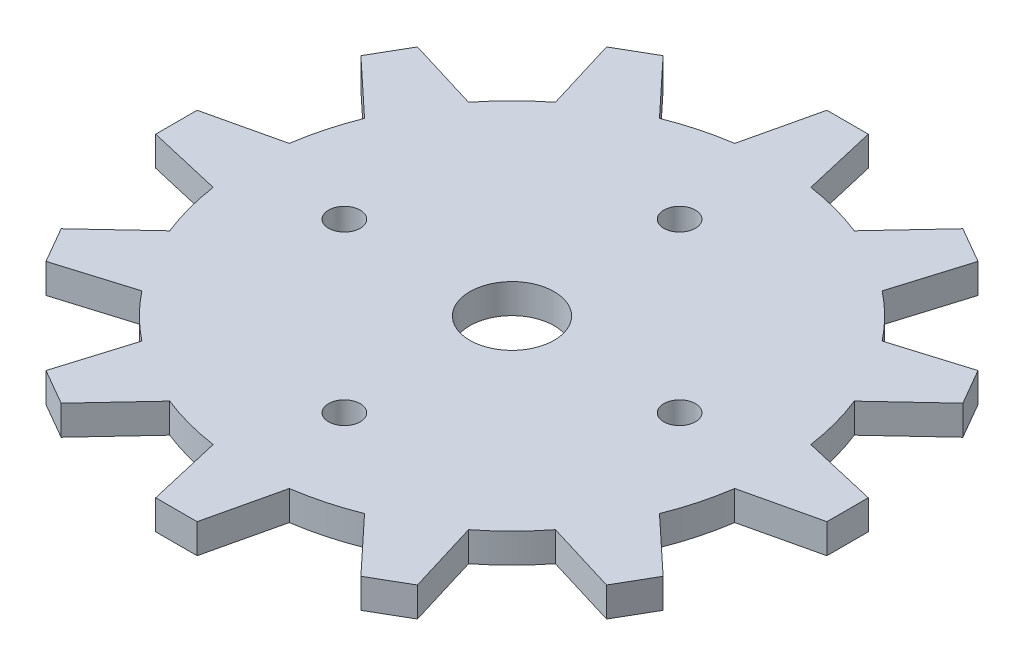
ISO-10303-21;
HEADER;
FILE_DESCRIPTION(('STEP AP214'),'2;1');
FILE_NAME('part.step','',(''),(''),'','','');
FILE_SCHEMA(('AUTOMOTIVE_DESIGN { 1 0 10303 214 1 1 1 1 }'));
ENDSEC;
DATA;
#1=APPLICATION_CONTEXT('core data for automotive mechanical design processes');
#2=APPLICATION_PROTOCOL_DEFINITION('international standard','automotive_design',2000,#1);
#3=PRODUCT_CONTEXT('',#1,'mechanical');
#4=PRODUCT('Part','Part','',(#3));
#5=PRODUCT_RELATED_PRODUCT_CATEGORY('part','',(#4));
#6=PRODUCT_DEFINITION_FORMATION('','',#4);
#7=PRODUCT_DEFINITION_CONTEXT('part definition',#1,'design');
#8=PRODUCT_DEFINITION('design','',#6,#7);
#9=PRODUCT_DEFINITION_SHAPE('','',#8);
#10=(LENGTH_UNIT() NAMED_UNIT(*) SI_UNIT(.MILLI.,.METRE.));
#11=(NAMED_UNIT(*) PLANE_ANGLE_UNIT() SI_UNIT($,.RADIAN.));
#12=(NAMED_UNIT(*) SI_UNIT($,.STERADIAN.) SOLID_ANGLE_UNIT());
#13=UNCERTAINTY_MEASURE_WITH_UNIT(LENGTH_MEASURE(1.E-05),#10,'distance_accuracy_value','');
#14=(GEOMETRIC_REPRESENTATION_CONTEXT(3) GLOBAL_UNCERTAINTY_ASSIGNED_CONTEXT((#13)) GLOBAL_UNIT_ASSIGNED_CONTEXT((#10,
#11,#12)) REPRESENTATION_CONTEXT('',''));
#15=CARTESIAN_POINT('',(0.,0.,0.));
#16=DIRECTION('',(0.,0.,1.));
#17=DIRECTION('',(1.,0.,0.));
#18=AXIS2_PLACEMENT_3D('',#15,#16,#17);
#19=CARTESIAN_POINT('',(0.,2.8,0.));
#20=DIRECTION('',(0.,-1.,0.));
#21=DIRECTION('',(0.,0.,-1.));
#22=AXIS2_PLACEMENT_3D('',#19,#20,#21);
#23=CYLINDRICAL_SURFACE('',#22,25.);
#24=CARTESIAN_POINT('',(0.,2.8,0.));
#25=DIRECTION('',(0.,1.,0.));
#26=DIRECTION('',(0.,0.,1.));
#27=AXIS2_PLACEMENT_3D('',#24,#25,#26);
#28=CIRCLE('',#27,25.);
#29=CARTESIAN_POINT('',(-23.2296720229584,2.8,-9.24025636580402));
#30=VERTEX_POINT('',#29);
#31=CARTESIAN_POINT('',(-24.7376142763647,2.8,-3.61253926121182));
#32=VERTEX_POINT('',#31);
#33=EDGE_CURVE('E44',#30,#32,#28,.T.);
#34=ORIENTED_EDGE('',*,*,#33,.F.);
#35=DIRECTION('',(0.,-1.,0.));
#36=VECTOR('',#35,1.);
#37=CARTESIAN_POINT('',(-23.2296720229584,2.8,-9.24025636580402));
#38=LINE('',#37,#36);
#39=CARTESIAN_POINT('',(-23.2296720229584,0.,-9.24025636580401));
#40=VERTEX_POINT('',#39);
#41=EDGE_CURVE('E375',#30,#40,#38,.T.);
#42=ORIENTED_EDGE('',*,*,#41,.T.);
#43=CARTESIAN_POINT('',(0.,0.,0.));
#44=DIRECTION('',(0.,1.,0.));
#45=DIRECTION('',(0.,0.,1.));
#46=AXIS2_PLACEMENT_3D('',#43,#44,#45);
#47=CIRCLE('',#46,25.);
#48=CARTESIAN_POINT('',(-24.7376142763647,0.,-3.61253926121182));
#49=VERTEX_POINT('',#48);
#50=EDGE_CURVE('E650',#40,#49,#47,.T.);
#51=ORIENTED_EDGE('',*,*,#50,.T.);
#52=DIRECTION('',(0.,-1.,0.));
#53=VECTOR('',#52,1.);
#54=CARTESIAN_POINT('',(-24.7376142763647,2.8,-3.61253926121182));
#55=LINE('',#54,#53);
#56=EDGE_CURVE('E643',#49,#32,#55,.F.);
#57=ORIENTED_EDGE('',*,*,#56,.T.);
#58=EDGE_LOOP('',(#34,#42,#51,#57));
#59=FACE_BOUND('',#58,.T.);
#60=ADVANCED_FACE('F33',(#59),#23,.T.);
#61=CARTESIAN_POINT('',(-15.4973579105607,0.,-19.6171327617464));
#62=VERTEX_POINT('',#61);
#63=CARTESIAN_POINT('',(-19.6171327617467,0.,-15.4973579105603));
#64=VERTEX_POINT('',#63);
#65=EDGE_CURVE('E738',#62,#64,#47,.T.);
#66=ORIENTED_EDGE('',*,*,#65,.T.);
#67=DIRECTION('',(0.,-1.,0.));
#68=VECTOR('',#67,1.);
#69=CARTESIAN_POINT('',(-19.6171327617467,2.8,-15.4973579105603));
#70=LINE('',#69,#68);
#71=CARTESIAN_POINT('',(-19.6171327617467,2.8,-15.4973579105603));
#72=VERTEX_POINT('',#71);
#73=EDGE_CURVE('E349',#64,#72,#70,.F.);
#74=ORIENTED_EDGE('',*,*,#73,.T.);
#75=CARTESIAN_POINT('',(-15.4973579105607,2.8,-19.6171327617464));
#76=VERTEX_POINT('',#75);
#77=EDGE_CURVE('E808',#76,#72,#28,.T.);
#78=ORIENTED_EDGE('',*,*,#77,.F.);
#79=DIRECTION('',(0.,-1.,0.));
#80=VECTOR('',#79,1.);
#81=CARTESIAN_POINT('',(-15.4973579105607,2.8,-19.6171327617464));
#82=LINE('',#81,#80);
#83=EDGE_CURVE('E398',#76,#62,#82,.T.);
#84=ORIENTED_EDGE('',*,*,#83,.T.);
#85=EDGE_LOOP('',(#66,#74,#78,#84));
#86=FACE_BOUND('',#85,.T.);
#87=ADVANCED_FACE('F687',(#86),#23,.T.);
#88=CARTESIAN_POINT('',(-3.61253926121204,0.,-24.7376142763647));
#89=VERTEX_POINT('',#88);
#90=CARTESIAN_POINT('',(-9.24025636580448,0.,-23.2296720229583));
#91=VERTEX_POINT('',#90);
#92=EDGE_CURVE('E739',#89,#91,#47,.T.);
#93=ORIENTED_EDGE('',*,*,#92,.T.);
#94=DIRECTION('',(0.,-1.,0.));
#95=VECTOR('',#94,1.);
#96=CARTESIAN_POINT('',(-9.24025636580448,2.8,-23.2296720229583));
#97=LINE('',#96,#95);
#98=CARTESIAN_POINT('',(-9.24025636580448,2.8,-23.2296720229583));
#99=VERTEX_POINT('',#98);
#100=EDGE_CURVE('E393',#91,#99,#97,.F.);
#101=ORIENTED_EDGE('',*,*,#100,.T.);
#102=CARTESIAN_POINT('',(-3.61253926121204,2.8,-24.7376142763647));
#103=VERTEX_POINT('',#102);
#104=EDGE_CURVE('E805',#103,#99,#28,.T.);
#105=ORIENTED_EDGE('',*,*,#104,.F.);
#106=DIRECTION('',(0.,-1.,0.));
#107=VECTOR('',#106,1.);
#108=CARTESIAN_POINT('',(-3.61253926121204,2.8,-24.7376142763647));
#109=LINE('',#108,#107);
#110=EDGE_CURVE('E423',#103,#89,#109,.T.);
#111=ORIENTED_EDGE('',*,*,#110,.T.);
#112=EDGE_LOOP('',(#93,#101,#105,#111));
#113=FACE_BOUND('',#112,.T.);
#114=ADVANCED_FACE('F693',(#113),#23,.T.);
#115=CARTESIAN_POINT('',(9.24025636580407,0.,-23.2296720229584));
#116=VERTEX_POINT('',#115);
#117=CARTESIAN_POINT('',(3.6125392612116,0.,-24.7376142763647));
#118=VERTEX_POINT('',#117);
#119=EDGE_CURVE('E741',#116,#118,#47,.T.);
#120=ORIENTED_EDGE('',*,*,#119,.T.);
#121=DIRECTION('',(0.,-1.,0.));
#122=VECTOR('',#121,1.);
#123=CARTESIAN_POINT('',(3.6125392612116,2.8,-24.7376142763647));
#124=LINE('',#123,#122);
#125=CARTESIAN_POINT('',(3.6125392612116,2.8,-24.7376142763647));
#126=VERTEX_POINT('',#125);
#127=EDGE_CURVE('E418',#118,#126,#124,.F.);
#128=ORIENTED_EDGE('',*,*,#127,.T.);
#129=CARTESIAN_POINT('',(9.24025636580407,2.8,-23.2296720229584));
#130=VERTEX_POINT('',#129);
#131=EDGE_CURVE('E802',#130,#126,#28,.T.);
#132=ORIENTED_EDGE('',*,*,#131,.F.);
#133=DIRECTION('',(0.,-1.,0.));
#134=VECTOR('',#133,1.);
#135=CARTESIAN_POINT('',(9.24025636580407,2.8,-23.2296720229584));
#136=LINE('',#135,#134);
#137=EDGE_CURVE('E448',#130,#116,#136,.T.);
#138=ORIENTED_EDGE('',*,*,#137,.T.);
#139=EDGE_LOOP('',(#120,#128,#132,#138));
#140=FACE_BOUND('',#139,.T.);
#141=ADVANCED_FACE('F928',(#140),#23,.T.);
#142=CARTESIAN_POINT('',(19.6171327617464,0.,-15.4973579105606));
#143=VERTEX_POINT('',#142);
#144=CARTESIAN_POINT('',(15.4973579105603,0.,-19.6171327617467));
#145=VERTEX_POINT('',#144);
#146=EDGE_CURVE('E745',#143,#145,#47,.T.);
#147=ORIENTED_EDGE('',*,*,#146,.T.);
#148=DIRECTION('',(0.,-1.,0.));
#149=VECTOR('',#148,1.);
#150=CARTESIAN_POINT('',(15.4973579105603,2.8,-19.6171327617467));
#151=LINE('',#150,#149);
#152=CARTESIAN_POINT('',(15.4973579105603,2.8,-19.6171327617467));
#153=VERTEX_POINT('',#152);
#154=EDGE_CURVE('E443',#145,#153,#151,.F.);
#155=ORIENTED_EDGE('',*,*,#154,.T.);
#156=CARTESIAN_POINT('',(19.6171327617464,2.8,-15.4973579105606));
#157=VERTEX_POINT('',#156);
#158=EDGE_CURVE('E799',#157,#153,#28,.T.);
#159=ORIENTED_EDGE('',*,*,#158,.F.);
#160=DIRECTION('',(0.,-1.,0.));
#161=VECTOR('',#160,1.);
#162=CARTESIAN_POINT('',(19.6171327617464,2.8,-15.4973579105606));
#163=LINE('',#162,#161);
#164=EDGE_CURVE('E473',#157,#143,#163,.T.);
#165=ORIENTED_EDGE('',*,*,#164,.T.);
#166=EDGE_LOOP('',(#147,#155,#159,#165));
#167=FACE_BOUND('',#166,.T.);
#168=ADVANCED_FACE('F924',(#167),#23,.T.);
#169=CARTESIAN_POINT('',(24.7376142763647,0.,-3.61253926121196));
#170=VERTEX_POINT('',#169);
#171=CARTESIAN_POINT('',(23.2296720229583,0.,-9.2402563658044));
#172=VERTEX_POINT('',#171);
#173=EDGE_CURVE('E749',#170,#172,#47,.T.);
#174=ORIENTED_EDGE('',*,*,#173,.T.);
#175=DIRECTION('',(0.,-1.,0.));
#176=VECTOR('',#175,1.);
#177=CARTESIAN_POINT('',(23.2296720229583,2.8,-9.2402563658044));
#178=LINE('',#177,#176);
#179=CARTESIAN_POINT('',(23.2296720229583,2.8,-9.2402563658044));
#180=VERTEX_POINT('',#179);
#181=EDGE_CURVE('E468',#172,#180,#178,.F.);
#182=ORIENTED_EDGE('',*,*,#181,.T.);
#183=CARTESIAN_POINT('',(24.7376142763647,2.8,-3.61253926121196));
#184=VERTEX_POINT('',#183);
#185=EDGE_CURVE('E796',#184,#180,#28,.T.);
#186=ORIENTED_EDGE('',*,*,#185,.F.);
#187=DIRECTION('',(0.,-1.,0.));
#188=VECTOR('',#187,1.);
#189=CARTESIAN_POINT('',(24.7376142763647,2.8,-3.61253926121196));
#190=LINE('',#189,#188);
#191=EDGE_CURVE('E498',#184,#170,#190,.T.);
#192=ORIENTED_EDGE('',*,*,#191,.T.);
#193=EDGE_LOOP('',(#174,#182,#186,#192));
#194=FACE_BOUND('',#193,.T.);
#195=ADVANCED_FACE('F920',(#194),#23,.T.);
#196=CARTESIAN_POINT('',(23.2296720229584,0.,9.24025636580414));
#197=VERTEX_POINT('',#196);
#198=CARTESIAN_POINT('',(24.7376142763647,0.,3.61253926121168));
#199=VERTEX_POINT('',#198);
#200=EDGE_CURVE('E753',#197,#199,#47,.T.);
#201=ORIENTED_EDGE('',*,*,#200,.T.);
#202=DIRECTION('',(0.,-1.,0.));
#203=VECTOR('',#202,1.);
#204=CARTESIAN_POINT('',(24.7376142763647,2.8,3.61253926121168));
#205=LINE('',#204,#203);
#206=CARTESIAN_POINT('',(24.7376142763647,2.8,3.61253926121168));
#207=VERTEX_POINT('',#206);
#208=EDGE_CURVE('E493',#199,#207,#205,.F.);
#209=ORIENTED_EDGE('',*,*,#208,.T.);
#210=CARTESIAN_POINT('',(23.2296720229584,2.8,9.24025636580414));
#211=VERTEX_POINT('',#210);
#212=EDGE_CURVE('E793',#211,#207,#28,.T.);
#213=ORIENTED_EDGE('',*,*,#212,.F.);
#214=DIRECTION('',(0.,-1.,0.));
#215=VECTOR('',#214,1.);
#216=CARTESIAN_POINT('',(23.2296720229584,2.8,9.24025636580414));
#217=LINE('',#216,#215);
#218=EDGE_CURVE('E523',#211,#197,#217,.T.);
#219=ORIENTED_EDGE('',*,*,#218,.T.);
#220=EDGE_LOOP('',(#201,#209,#213,#219));
#221=FACE_BOUND('',#220,.T.);
#222=ADVANCED_FACE('F916',(#221),#23,.T.);
#223=CARTESIAN_POINT('',(15.4973579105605,0.,19.6171327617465));
#224=VERTEX_POINT('',#223);
#225=CARTESIAN_POINT('',(19.6171327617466,0.,15.4973579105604));
#226=VERTEX_POINT('',#225);
#227=EDGE_CURVE('E757',#224,#226,#47,.T.);
#228=ORIENTED_EDGE('',*,*,#227,.T.);
#229=DIRECTION('',(0.,-1.,0.));
#230=VECTOR('',#229,1.);
#231=CARTESIAN_POINT('',(19.6171327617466,2.8,15.4973579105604));
#232=LINE('',#231,#230);
#233=CARTESIAN_POINT('',(19.6171327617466,2.8,15.4973579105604));
#234=VERTEX_POINT('',#233);
#235=EDGE_CURVE('E518',#226,#234,#232,.F.);
#236=ORIENTED_EDGE('',*,*,#235,.T.);
#237=CARTESIAN_POINT('',(15.4973579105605,2.8,19.6171327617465));
#238=VERTEX_POINT('',#237);
#239=EDGE_CURVE('E790',#238,#234,#28,.T.);
#240=ORIENTED_EDGE('',*,*,#239,.F.);
#241=DIRECTION('',(0.,-1.,0.));
#242=VECTOR('',#241,1.);
#243=CARTESIAN_POINT('',(15.4973579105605,2.8,19.6171327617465));
#244=LINE('',#243,#242);
#245=EDGE_CURVE('E548',#238,#224,#244,.T.);
#246=ORIENTED_EDGE('',*,*,#245,.T.);
#247=EDGE_LOOP('',(#228,#236,#240,#246));
#248=FACE_BOUND('',#247,.T.);
#249=ADVANCED_FACE('F912',(#248),#23,.T.);
#250=CARTESIAN_POINT('',(3.61253926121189,0.,24.7376142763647));
#251=VERTEX_POINT('',#250);
#252=CARTESIAN_POINT('',(9.24025636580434,0.,23.2296720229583));
#253=VERTEX_POINT('',#252);
#254=EDGE_CURVE('E761',#251,#253,#47,.T.);
#255=ORIENTED_EDGE('',*,*,#254,.T.);
#256=DIRECTION('',(0.,-1.,0.));
#257=VECTOR('',#256,1.);
#258=CARTESIAN_POINT('',(9.24025636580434,2.8,23.2296720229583));
#259=LINE('',#258,#257);
#260=CARTESIAN_POINT('',(9.24025636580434,2.8,23.2296720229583));
#261=VERTEX_POINT('',#260);
#262=EDGE_CURVE('E543',#253,#261,#259,.F.);
#263=ORIENTED_EDGE('',*,*,#262,.T.);
#264=CARTESIAN_POINT('',(3.61253926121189,2.8,24.7376142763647));
#265=VERTEX_POINT('',#264);
#266=EDGE_CURVE('E787',#265,#261,#28,.T.);
#267=ORIENTED_EDGE('',*,*,#266,.F.);
#268=DIRECTION('',(0.,-1.,0.));
#269=VECTOR('',#268,1.);
#270=CARTESIAN_POINT('',(3.61253926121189,2.8,24.7376142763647));
#271=LINE('',#270,#269);
#272=EDGE_CURVE('E573',#265,#251,#271,.T.);
#273=ORIENTED_EDGE('',*,*,#272,.T.);
#274=EDGE_LOOP('',(#255,#263,#267,#273));
#275=FACE_BOUND('',#274,.T.);
#276=ADVANCED_FACE('F908',(#275),#23,.T.);
#277=CARTESIAN_POINT('',(-9.24025636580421,0.,23.2296720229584));
#278=VERTEX_POINT('',#277);
#279=CARTESIAN_POINT('',(-3.61253926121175,0.,24.7376142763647));
#280=VERTEX_POINT('',#279);
#281=EDGE_CURVE('E765',#278,#280,#47,.T.);
#282=ORIENTED_EDGE('',*,*,#281,.T.);
#283=DIRECTION('',(0.,-1.,0.));
#284=VECTOR('',#283,1.);
#285=CARTESIAN_POINT('',(-3.61253926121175,2.8,24.7376142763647));
#286=LINE('',#285,#284);
#287=CARTESIAN_POINT('',(-3.61253926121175,2.8,24.7376142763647));
#288=VERTEX_POINT('',#287);
#289=EDGE_CURVE('E568',#280,#288,#286,.F.);
#290=ORIENTED_EDGE('',*,*,#289,.T.);
#291=CARTESIAN_POINT('',(-9.24025636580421,2.8,23.2296720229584));
#292=VERTEX_POINT('',#291);
#293=EDGE_CURVE('E786',#292,#288,#28,.T.);
#294=ORIENTED_EDGE('',*,*,#293,.F.);
#295=DIRECTION('',(0.,-1.,0.));
#296=VECTOR('',#295,1.);
#297=CARTESIAN_POINT('',(-9.24025636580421,2.8,23.2296720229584));
#298=LINE('',#297,#296);
#299=EDGE_CURVE('E598',#292,#278,#298,.T.);
#300=ORIENTED_EDGE('',*,*,#299,.T.);
#301=EDGE_LOOP('',(#282,#290,#294,#300));
#302=FACE_BOUND('',#301,.T.);
#303=ADVANCED_FACE('F707',(#302),#23,.T.);
#304=CARTESIAN_POINT('',(-19.6171327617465,0.,15.4973579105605));
#305=VERTEX_POINT('',#304);
#306=CARTESIAN_POINT('',(-15.4973579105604,0.,19.6171327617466));
#307=VERTEX_POINT('',#306);
#308=EDGE_CURVE('E655',#305,#307,#47,.T.);
#309=ORIENTED_EDGE('',*,*,#308,.T.);
#310=DIRECTION('',(0.,-1.,0.));
#311=VECTOR('',#310,1.);
#312=CARTESIAN_POINT('',(-15.4973579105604,2.8,19.6171327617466));
#313=LINE('',#312,#311);
#314=CARTESIAN_POINT('',(-15.4973579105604,2.8,19.6171327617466));
#315=VERTEX_POINT('',#314);
#316=EDGE_CURVE('E593',#307,#315,#313,.F.);
#317=ORIENTED_EDGE('',*,*,#316,.T.);
#318=CARTESIAN_POINT('',(-19.6171327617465,2.8,15.4973579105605));
#319=VERTEX_POINT('',#318);
#320=EDGE_CURVE('E42',#319,#315,#28,.T.);
#321=ORIENTED_EDGE('',*,*,#320,.F.);
#322=DIRECTION('',(0.,-1.,0.));
#323=VECTOR('',#322,1.);
#324=CARTESIAN_POINT('',(-19.6171327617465,2.8,15.4973579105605));
#325=LINE('',#324,#323);
#326=EDGE_CURVE('E623',#319,#305,#325,.T.);
#327=ORIENTED_EDGE('',*,*,#326,.T.);
#328=EDGE_LOOP('',(#309,#317,#321,#327));
#329=FACE_BOUND('',#328,.T.);
#330=ADVANCED_FACE('F698',(#329),#23,.T.);
#331=CARTESIAN_POINT('',(-24.7376142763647,0.,3.61253926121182));
#332=VERTEX_POINT('',#331);
#333=CARTESIAN_POINT('',(-23.2296720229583,0.,9.24025636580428));
#334=VERTEX_POINT('',#333);
#335=EDGE_CURVE('E652',#332,#334,#47,.T.);
#336=ORIENTED_EDGE('',*,*,#335,.T.);
#337=DIRECTION('',(0.,-1.,0.));
#338=VECTOR('',#337,1.);
#339=CARTESIAN_POINT('',(-23.2296720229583,2.8,9.24025636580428));
#340=LINE('',#339,#338);
#341=CARTESIAN_POINT('',(-23.2296720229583,2.8,9.24025636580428));
#342=VERTEX_POINT('',#341);
#343=EDGE_CURVE('E618',#334,#342,#340,.F.);
#344=ORIENTED_EDGE('',*,*,#343,.T.);
#345=CARTESIAN_POINT('',(-24.7376142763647,2.8,3.61253926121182));
#346=VERTEX_POINT('',#345);
#347=EDGE_CURVE('E11',#346,#342,#28,.T.);
#348=ORIENTED_EDGE('',*,*,#347,.F.);
#349=DIRECTION('',(0.,-1.,0.));
#350=VECTOR('',#349,1.);
#351=CARTESIAN_POINT('',(-24.7376142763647,2.8,3.61253926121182));
#352=LINE('',#351,#350);
#353=EDGE_CURVE('E648',#346,#332,#352,.T.);
#354=ORIENTED_EDGE('',*,*,#353,.T.);
#355=EDGE_LOOP('',(#336,#344,#348,#354));
#356=FACE_BOUND('',#355,.T.);
#357=ADVANCED_FACE('F35',(#356),#23,.T.);
#358=CARTESIAN_POINT('',(0.,2.8,0.));
#359=DIRECTION('',(0.,1.,0.));
#360=DIRECTION('',(0.,0.,1.));
#361=AXIS2_PLACEMENT_3D('',#358,#359,#360);
#362=PLANE('',#361);
#363=CARTESIAN_POINT('',(0.,2.8,15.9));
#364=DIRECTION('',(0.,1.,0.));
#365=DIRECTION('',(0.,0.,1.));
#366=AXIS2_PLACEMENT_3D('',#363,#364,#365);
#367=CIRCLE('',#366,1.5);
#368=CARTESIAN_POINT('',(0.,2.8,17.4));
#369=VERTEX_POINT('',#368);
#370=EDGE_CURVE('E1427',#369,#369,#367,.T.);
#371=ORIENTED_EDGE('',*,*,#370,.F.);
#372=EDGE_LOOP('',(#371));
#373=FACE_BOUND('',#372,.T.);
#374=CARTESIAN_POINT('',(-15.9,2.8,0.));
#375=DIRECTION('',(0.,1.,0.));
#376=DIRECTION('',(0.,0.,1.));
#377=AXIS2_PLACEMENT_3D('',#374,#375,#376);
#378=CIRCLE('',#377,1.5);
#379=CARTESIAN_POINT('',(-15.9,2.8,1.5));
#380=VERTEX_POINT('',#379);
#381=EDGE_CURVE('E1423',#380,#380,#378,.T.);
#382=ORIENTED_EDGE('',*,*,#381,.F.);
#383=EDGE_LOOP('',(#382));
#384=FACE_BOUND('',#383,.T.);
#385=CARTESIAN_POINT('',(0.,2.8,-15.9));
#386=DIRECTION('',(0.,1.,0.));
#387=DIRECTION('',(0.,0.,1.));
#388=AXIS2_PLACEMENT_3D('',#385,#386,#387);
#389=CIRCLE('',#388,1.5);
#390=CARTESIAN_POINT('',(0.,2.8,-14.4));
#391=VERTEX_POINT('',#390);
#392=EDGE_CURVE('E1413',#391,#391,#389,.T.);
#393=ORIENTED_EDGE('',*,*,#392,.F.);
#394=EDGE_LOOP('',(#393));
#395=FACE_BOUND('',#394,.T.);
#396=CARTESIAN_POINT('',(15.9,2.8,0.));
#397=DIRECTION('',(0.,1.,0.));
#398=DIRECTION('',(0.,0.,1.));
#399=AXIS2_PLACEMENT_3D('',#396,#397,#398);
#400=CIRCLE('',#399,1.5);
#401=CARTESIAN_POINT('',(15.9,2.8,1.5));
#402=VERTEX_POINT('',#401);
#403=EDGE_CURVE('E1424',#402,#402,#400,.T.);
#404=ORIENTED_EDGE('',*,*,#403,.F.);
#405=EDGE_LOOP('',(#404));
#406=FACE_BOUND('',#405,.T.);
#407=CARTESIAN_POINT('',(0.,2.8,0.));
#408=DIRECTION('',(0.,1.,0.));
#409=DIRECTION('',(0.,0.,1.));
#410=AXIS2_PLACEMENT_3D('',#407,#408,#409);
#411=CIRCLE('',#410,4.);
#412=CARTESIAN_POINT('',(0.,2.8,4.));
#413=VERTEX_POINT('',#412);
#414=EDGE_CURVE('E660',#413,#413,#411,.T.);
#415=ORIENTED_EDGE('',*,*,#414,.F.);
#416=EDGE_LOOP('',(#415));
#417=FACE_BOUND('',#416,.T.);
#418=ORIENTED_EDGE('',*,*,#77,.T.);
#419=DIRECTION('',(-0.956703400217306,0.,-0.29106460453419));
#420=VECTOR('',#419,1.);
#421=CARTESIAN_POINT('',(-17.9789802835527,2.8,-14.9989712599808));
#422=LINE('',#421,#420);
#423=CARTESIAN_POINT('',(-26.5893108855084,2.8,-17.6185527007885));
#424=VERTEX_POINT('',#423);
#425=EDGE_CURVE('E370',#72,#424,#422,.T.);
#426=ORIENTED_EDGE('',*,*,#425,.T.);
#427=DIRECTION('',(-0.499999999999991,0.,0.866025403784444));
#428=VECTOR('',#427,1.);
#429=CARTESIAN_POINT('',(-28.5527696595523,2.8,-14.2177423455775));
#430=LINE('',#429,#428);
#431=CARTESIAN_POINT('',(-28.5527696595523,2.8,-14.2177423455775));
#432=VERTEX_POINT('',#431);
#433=EDGE_CURVE('E360',#424,#432,#430,.T.);
#434=ORIENTED_EDGE('',*,*,#433,.T.);
#435=DIRECTION('',(0.730421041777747,0.,0.682997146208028));
#436=VECTOR('',#435,1.);
#437=CARTESIAN_POINT('',(-21.9789802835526,2.8,-8.07076802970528));
#438=LINE('',#437,#436);
#439=EDGE_CURVE('E51',#432,#30,#438,.T.);
#440=ORIENTED_EDGE('',*,*,#439,.T.);
#441=ORIENTED_EDGE('',*,*,#33,.T.);
#442=DIRECTION('',(-0.974061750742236,0.,0.226282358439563));
#443=VECTOR('',#442,1.);
#444=CARTESIAN_POINT('',(-23.0697392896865,2.8,-4.));
#445=LINE('',#444,#443);
#446=CARTESIAN_POINT('',(-31.8362950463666,2.8,-1.96345877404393));
#447=VERTEX_POINT('',#446);
#448=EDGE_CURVE('E637',#32,#447,#445,.T.);
#449=ORIENTED_EDGE('',*,*,#448,.T.);
#450=DIRECTION('',(0.,0.,1.));
#451=VECTOR('',#450,1.);
#452=CARTESIAN_POINT('',(-31.8362950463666,2.8,1.96345877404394));
#453=LINE('',#452,#451);
#454=CARTESIAN_POINT('',(-31.8362950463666,2.8,1.96345877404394));
#455=VERTEX_POINT('',#454);
#456=EDGE_CURVE('E630',#447,#455,#453,.T.);
#457=ORIENTED_EDGE('',*,*,#456,.T.);
#458=DIRECTION('',(0.974061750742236,0.,0.226282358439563));
#459=VECTOR('',#458,1.);
#460=CARTESIAN_POINT('',(-23.0697392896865,2.8,4.));
#461=LINE('',#460,#459);
#462=EDGE_CURVE('E626',#455,#346,#461,.T.);
#463=ORIENTED_EDGE('',*,*,#462,.T.);
#464=ORIENTED_EDGE('',*,*,#347,.T.);
#465=DIRECTION('',(-0.73042104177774,0.,0.682997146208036));
#466=VECTOR('',#465,1.);
#467=CARTESIAN_POINT('',(-21.9789802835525,2.8,8.07076802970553));
#468=LINE('',#467,#466);
#469=CARTESIAN_POINT('',(-28.5527696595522,2.8,14.2177423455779));
#470=VERTEX_POINT('',#469);
#471=EDGE_CURVE('E612',#342,#470,#468,.T.);
#472=ORIENTED_EDGE('',*,*,#471,.T.);
#473=DIRECTION('',(0.500000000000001,0.,0.866025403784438));
#474=VECTOR('',#473,1.);
#475=CARTESIAN_POINT('',(-26.5893108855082,2.8,17.6185527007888));
#476=LINE('',#475,#474);
#477=CARTESIAN_POINT('',(-26.5893108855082,2.8,17.6185527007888));
#478=VERTEX_POINT('',#477);
#479=EDGE_CURVE('E605',#470,#478,#476,.T.);
#480=ORIENTED_EDGE('',*,*,#479,.T.);
#481=DIRECTION('',(0.956703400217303,0.,-0.291064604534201));
#482=VECTOR('',#481,1.);
#483=CARTESIAN_POINT('',(-17.9789802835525,2.8,14.998971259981));
#484=LINE('',#483,#482);
#485=EDGE_CURVE('E601',#478,#319,#484,.T.);
#486=ORIENTED_EDGE('',*,*,#485,.T.);
#487=ORIENTED_EDGE('',*,*,#320,.T.);
#488=DIRECTION('',(-0.291064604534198,0.,0.956703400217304));
#489=VECTOR('',#488,1.);
#490=CARTESIAN_POINT('',(-14.998971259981,2.8,17.9789802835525));
#491=LINE('',#490,#489);
#492=CARTESIAN_POINT('',(-17.6185527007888,2.8,26.5893108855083));
#493=VERTEX_POINT('',#492);
#494=EDGE_CURVE('E587',#315,#493,#491,.T.);
#495=ORIENTED_EDGE('',*,*,#494,.T.);
#496=DIRECTION('',(0.86602540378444,0.,0.499999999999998));
#497=VECTOR('',#496,1.);
#498=CARTESIAN_POINT('',(-14.2177423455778,2.8,28.5527696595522));
#499=LINE('',#498,#497);
#500=CARTESIAN_POINT('',(-14.2177423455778,2.8,28.5527696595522));
#501=VERTEX_POINT('',#500);
#502=EDGE_CURVE('E580',#493,#501,#499,.T.);
#503=ORIENTED_EDGE('',*,*,#502,.T.);
#504=DIRECTION('',(0.682997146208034,0.,-0.730421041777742));
#505=VECTOR('',#504,1.);
#506=CARTESIAN_POINT('',(-8.07076802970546,2.8,21.9789802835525));
#507=LINE('',#506,#505);
#508=EDGE_CURVE('E576',#501,#292,#507,.T.);
#509=ORIENTED_EDGE('',*,*,#508,.T.);
#510=ORIENTED_EDGE('',*,*,#293,.T.);
#511=DIRECTION('',(0.226282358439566,0.,0.974061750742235));
#512=VECTOR('',#511,1.);
#513=CARTESIAN_POINT('',(-3.99999999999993,2.8,23.0697392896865));
#514=LINE('',#513,#512);
#515=CARTESIAN_POINT('',(-1.96345877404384,2.8,31.8362950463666));
#516=VERTEX_POINT('',#515);
#517=EDGE_CURVE('E562',#288,#516,#514,.T.);
#518=ORIENTED_EDGE('',*,*,#517,.T.);
#519=DIRECTION('',(1.,0.,0.));
#520=VECTOR('',#519,1.);
#521=CARTESIAN_POINT('',(1.96345877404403,2.8,31.8362950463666));
#522=LINE('',#521,#520);
#523=CARTESIAN_POINT('',(1.96345877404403,2.8,31.8362950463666));
#524=VERTEX_POINT('',#523);
#525=EDGE_CURVE('E555',#516,#524,#522,.T.);
#526=ORIENTED_EDGE('',*,*,#525,.T.);
#527=DIRECTION('',(0.22628235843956,0.,-0.974061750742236));
#528=VECTOR('',#527,1.);
#529=CARTESIAN_POINT('',(4.00000000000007,2.8,23.0697392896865));
#530=LINE('',#529,#528);
#531=EDGE_CURVE('E551',#524,#265,#530,.T.);
#532=ORIENTED_EDGE('',*,*,#531,.T.);
#533=ORIENTED_EDGE('',*,*,#266,.T.);
#534=DIRECTION('',(0.682997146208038,0.,0.730421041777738));
#535=VECTOR('',#534,1.);
#536=CARTESIAN_POINT('',(8.07076802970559,2.8,21.9789802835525));
#537=LINE('',#536,#535);
#538=CARTESIAN_POINT('',(14.2177423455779,2.8,28.5527696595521));
#539=VERTEX_POINT('',#538);
#540=EDGE_CURVE('E537',#261,#539,#537,.T.);
#541=ORIENTED_EDGE('',*,*,#540,.T.);
#542=DIRECTION('',(0.866025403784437,0.,-0.500000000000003));
#543=VECTOR('',#542,1.);
#544=CARTESIAN_POINT('',(17.6185527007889,2.8,26.5893108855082));
#545=LINE('',#544,#543);
#546=CARTESIAN_POINT('',(17.6185527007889,2.8,26.5893108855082));
#547=VERTEX_POINT('',#546);
#548=EDGE_CURVE('E530',#539,#547,#545,.T.);
#549=ORIENTED_EDGE('',*,*,#548,.T.);
#550=DIRECTION('',(-0.291064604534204,0.,-0.956703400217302));
#551=VECTOR('',#550,1.);
#552=CARTESIAN_POINT('',(14.9989712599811,2.8,17.9789802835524));
#553=LINE('',#552,#551);
#554=EDGE_CURVE('E526',#547,#238,#553,.T.);
#555=ORIENTED_EDGE('',*,*,#554,.T.);
#556=ORIENTED_EDGE('',*,*,#239,.T.);
#557=DIRECTION('',(0.956703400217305,0.,0.291064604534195));
#558=VECTOR('',#557,1.);
#559=CARTESIAN_POINT('',(17.9789802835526,2.8,14.9989712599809));
#560=LINE('',#559,#558);
#561=CARTESIAN_POINT('',(26.5893108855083,2.8,17.6185527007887));
#562=VERTEX_POINT('',#561);
#563=EDGE_CURVE('E512',#234,#562,#560,.T.);
#564=ORIENTED_EDGE('',*,*,#563,.T.);
#565=DIRECTION('',(0.499999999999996,0.,-0.866025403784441));
#566=VECTOR('',#565,1.);
#567=CARTESIAN_POINT('',(28.5527696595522,2.8,14.2177423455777));
#568=LINE('',#567,#566);
#569=CARTESIAN_POINT('',(28.5527696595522,2.8,14.2177423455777));
#570=VERTEX_POINT('',#569);
#571=EDGE_CURVE('E505',#562,#570,#568,.T.);
#572=ORIENTED_EDGE('',*,*,#571,.T.);
#573=DIRECTION('',(-0.730421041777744,0.,-0.682997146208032));
#574=VECTOR('',#573,1.);
#575=CARTESIAN_POINT('',(21.9789802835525,2.8,8.07076802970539));
#576=LINE('',#575,#574);
#577=EDGE_CURVE('E501',#570,#211,#576,.T.);
#578=ORIENTED_EDGE('',*,*,#577,.T.);
#579=ORIENTED_EDGE('',*,*,#212,.T.);
#580=DIRECTION('',(0.974061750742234,0.,-0.226282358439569));
#581=VECTOR('',#580,1.);
#582=CARTESIAN_POINT('',(23.0697392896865,2.8,3.99999999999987));
#583=LINE('',#582,#581);
#584=CARTESIAN_POINT('',(31.8362950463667,2.8,1.96345877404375));
#585=VERTEX_POINT('',#584);
#586=EDGE_CURVE('E487',#207,#585,#583,.T.);
#587=ORIENTED_EDGE('',*,*,#586,.T.);
#588=DIRECTION('',(0.,0.,-1.));
#589=VECTOR('',#588,1.);
#590=CARTESIAN_POINT('',(31.8362950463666,2.8,-1.96345877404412));
#591=LINE('',#590,#589);
#592=CARTESIAN_POINT('',(31.8362950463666,2.8,-1.96345877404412));
#593=VERTEX_POINT('',#592);
#594=EDGE_CURVE('E480',#585,#593,#591,.T.);
#595=ORIENTED_EDGE('',*,*,#594,.T.);
#596=DIRECTION('',(-0.974061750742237,0.,-0.226282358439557));
#597=VECTOR('',#596,1.);
#598=CARTESIAN_POINT('',(23.0697392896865,2.8,-4.00000000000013));
#599=LINE('',#598,#597);
#600=EDGE_CURVE('E476',#593,#184,#599,.T.);
#601=ORIENTED_EDGE('',*,*,#600,.T.);
#602=ORIENTED_EDGE('',*,*,#185,.T.);
#603=DIRECTION('',(0.730421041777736,0.,-0.68299714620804));
#604=VECTOR('',#603,1.);
#605=CARTESIAN_POINT('',(21.9789802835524,2.8,-8.07076802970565));
#606=LINE('',#605,#604);
#607=CARTESIAN_POINT('',(28.5527696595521,2.8,-14.217742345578));
#608=VERTEX_POINT('',#607);
#609=EDGE_CURVE('E462',#180,#608,#606,.T.);
#610=ORIENTED_EDGE('',*,*,#609,.T.);
#611=DIRECTION('',(-0.500000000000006,0.,-0.866025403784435));
#612=VECTOR('',#611,1.);
#613=CARTESIAN_POINT('',(26.5893108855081,2.8,-17.618552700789));
#614=LINE('',#613,#612);
#615=CARTESIAN_POINT('',(26.5893108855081,2.8,-17.618552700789));
#616=VERTEX_POINT('',#615);
#617=EDGE_CURVE('E455',#608,#616,#614,.T.);
#618=ORIENTED_EDGE('',*,*,#617,.T.);
#619=DIRECTION('',(-0.956703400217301,0.,0.291064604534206));
#620=VECTOR('',#619,1.);
#621=CARTESIAN_POINT('',(17.9789802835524,2.8,-14.9989712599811));
#622=LINE('',#621,#620);
#623=EDGE_CURVE('E451',#616,#157,#622,.T.);
#624=ORIENTED_EDGE('',*,*,#623,.T.);
#625=ORIENTED_EDGE('',*,*,#158,.T.);
#626=DIRECTION('',(0.291064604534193,0.,-0.956703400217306));
#627=VECTOR('',#626,1.);
#628=CARTESIAN_POINT('',(14.9989712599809,2.8,-17.9789802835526));
#629=LINE('',#628,#627);
#630=CARTESIAN_POINT('',(17.6185527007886,2.8,-26.5893108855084));
#631=VERTEX_POINT('',#630);
#632=EDGE_CURVE('E437',#153,#631,#629,.T.);
#633=ORIENTED_EDGE('',*,*,#632,.T.);
#634=DIRECTION('',(-0.866025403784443,0.,-0.499999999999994));
#635=VECTOR('',#634,1.);
#636=CARTESIAN_POINT('',(14.2177423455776,2.8,-28.5527696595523));
#637=LINE('',#636,#635);
#638=CARTESIAN_POINT('',(14.2177423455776,2.8,-28.5527696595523));
#639=VERTEX_POINT('',#638);
#640=EDGE_CURVE('E430',#631,#639,#637,.T.);
#641=ORIENTED_EDGE('',*,*,#640,.T.);
#642=DIRECTION('',(-0.68299714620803,0.,0.730421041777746));
#643=VECTOR('',#642,1.);
#644=CARTESIAN_POINT('',(8.07076802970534,2.8,-21.9789802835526));
#645=LINE('',#644,#643);
#646=EDGE_CURVE('E426',#639,#130,#645,.T.);
#647=ORIENTED_EDGE('',*,*,#646,.T.);
#648=ORIENTED_EDGE('',*,*,#131,.T.);
#649=DIRECTION('',(-0.226282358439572,0.,-0.974061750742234));
#650=VECTOR('',#649,1.);
#651=CARTESIAN_POINT('',(3.9999999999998,2.8,-23.0697392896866));
#652=LINE('',#651,#650);
#653=CARTESIAN_POINT('',(1.96345877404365,2.8,-31.8362950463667));
#654=VERTEX_POINT('',#653);
#655=EDGE_CURVE('E412',#126,#654,#652,.T.);
#656=ORIENTED_EDGE('',*,*,#655,.T.);
#657=DIRECTION('',(-1.,0.,0.));
#658=VECTOR('',#657,1.);
#659=CARTESIAN_POINT('',(-1.96345877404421,2.8,-31.8362950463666));
#660=LINE('',#659,#658);
#661=CARTESIAN_POINT('',(-1.96345877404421,2.8,-31.8362950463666));
#662=VERTEX_POINT('',#661);
#663=EDGE_CURVE('E405',#654,#662,#660,.T.);
#664=ORIENTED_EDGE('',*,*,#663,.T.);
#665=DIRECTION('',(-0.226282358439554,0.,0.974061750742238));
#666=VECTOR('',#665,1.);
#667=CARTESIAN_POINT('',(-4.0000000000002,2.8,-23.0697392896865));
#668=LINE('',#667,#666);
#669=EDGE_CURVE('E401',#662,#103,#668,.T.);
#670=ORIENTED_EDGE('',*,*,#669,.T.);
#671=ORIENTED_EDGE('',*,*,#104,.T.);
#672=DIRECTION('',(-0.682997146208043,0.,-0.730421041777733));
#673=VECTOR('',#672,1.);
#674=CARTESIAN_POINT('',(-8.07076802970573,2.8,-21.9789802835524));
#675=LINE('',#674,#673);
#676=CARTESIAN_POINT('',(-14.2177423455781,2.8,-28.552769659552));
#677=VERTEX_POINT('',#676);
#678=EDGE_CURVE('E388',#99,#677,#675,.T.);
#679=ORIENTED_EDGE('',*,*,#678,.T.);
#680=DIRECTION('',(-0.866025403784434,0.,0.500000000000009));
#681=VECTOR('',#680,1.);
#682=CARTESIAN_POINT('',(-17.6185527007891,2.8,-26.5893108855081));
#683=LINE('',#682,#681);
#684=CARTESIAN_POINT('',(-17.6185527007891,2.8,-26.5893108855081));
#685=VERTEX_POINT('',#684);
#686=EDGE_CURVE('E381',#677,#685,#683,.T.);
#687=ORIENTED_EDGE('',*,*,#686,.T.);
#688=DIRECTION('',(0.29106460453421,0.,0.9567034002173));
#689=VECTOR('',#688,1.);
#690=CARTESIAN_POINT('',(-14.9989712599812,2.8,-17.9789802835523));
#691=LINE('',#690,#689);
#692=EDGE_CURVE('E58',#685,#76,#691,.T.);
#693=ORIENTED_EDGE('',*,*,#692,.T.);
#694=EDGE_LOOP('',(#418,#426,#434,#440,#441,#449,#457,#463,#464,#472,#480,#486,#487,#495,#503,
#509,#510,#518,#526,#532,#533,#541,#549,#555,#556,#564,#572,#578,#579,#587,#595,#601,#602,#610,
#618,#624,#625,#633,#641,#647,#648,#656,#664,#670,#671,#679,#687,#693));
#695=FACE_BOUND('',#694,.T.);
#696=ADVANCED_FACE('F697',(#373,#384,#395,#406,#417,#695),#362,.T.);
#697=CARTESIAN_POINT('',(0.,0.,0.));
#698=DIRECTION('',(0.,1.,0.));
#699=DIRECTION('',(0.,0.,1.));
#700=AXIS2_PLACEMENT_3D('',#697,#698,#699);
#701=PLANE('',#700);
#702=CARTESIAN_POINT('',(0.,0.,15.9));
#703=DIRECTION('',(0.,1.,0.));
#704=DIRECTION('',(0.,0.,1.));
#705=AXIS2_PLACEMENT_3D('',#702,#703,#704);
#706=CIRCLE('',#705,1.5);
#707=CARTESIAN_POINT('',(0.,0.,17.4));
#708=VERTEX_POINT('',#707);
#709=EDGE_CURVE('E37',#708,#708,#706,.T.);
#710=ORIENTED_EDGE('',*,*,#709,.T.);
#711=EDGE_LOOP('',(#710));
#712=FACE_BOUND('',#711,.T.);
#713=CARTESIAN_POINT('',(-15.9,0.,0.));
#714=DIRECTION('',(0.,1.,0.));
#715=DIRECTION('',(0.,0.,1.));
#716=AXIS2_PLACEMENT_3D('',#713,#714,#715);
#717=CIRCLE('',#716,1.5);
#718=CARTESIAN_POINT('',(-15.9,0.,1.5));
#719=VERTEX_POINT('',#718);
#720=EDGE_CURVE('E665',#719,#719,#717,.T.);
#721=ORIENTED_EDGE('',*,*,#720,.T.);
#722=EDGE_LOOP('',(#721));
#723=FACE_BOUND('',#722,.T.);
#724=CARTESIAN_POINT('',(0.,0.,-15.9));
#725=DIRECTION('',(0.,1.,0.));
#726=DIRECTION('',(0.,0.,1.));
#727=AXIS2_PLACEMENT_3D('',#724,#725,#726);
#728=CIRCLE('',#727,1.5);
#729=CARTESIAN_POINT('',(0.,0.,-14.4));
#730=VERTEX_POINT('',#729);
#731=EDGE_CURVE('E663',#730,#730,#728,.T.);
#732=ORIENTED_EDGE('',*,*,#731,.T.);
#733=EDGE_LOOP('',(#732));
#734=FACE_BOUND('',#733,.T.);
#735=CARTESIAN_POINT('',(15.9,0.,0.));
#736=DIRECTION('',(0.,1.,0.));
#737=DIRECTION('',(0.,0.,1.));
#738=AXIS2_PLACEMENT_3D('',#735,#736,#737);
#739=CIRCLE('',#738,1.5);
#740=CARTESIAN_POINT('',(15.9,0.,1.5));
#741=VERTEX_POINT('',#740);
#742=EDGE_CURVE('E659',#741,#741,#739,.T.);
#743=ORIENTED_EDGE('',*,*,#742,.T.);
#744=EDGE_LOOP('',(#743));
#745=FACE_BOUND('',#744,.T.);
#746=CARTESIAN_POINT('',(0.,0.,0.));
#747=DIRECTION('',(0.,1.,0.));
#748=DIRECTION('',(0.,0.,1.));
#749=AXIS2_PLACEMENT_3D('',#746,#747,#748);
#750=CIRCLE('',#749,4.);
#751=CARTESIAN_POINT('',(0.,0.,4.));
#752=VERTEX_POINT('',#751);
#753=EDGE_CURVE('E656',#752,#752,#750,.T.);
#754=ORIENTED_EDGE('',*,*,#753,.T.);
#755=EDGE_LOOP('',(#754));
#756=FACE_BOUND('',#755,.T.);
#757=ORIENTED_EDGE('',*,*,#50,.F.);
#758=DIRECTION('',(0.730421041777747,0.,0.682997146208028));
#759=VECTOR('',#758,1.);
#760=CARTESIAN_POINT('',(-21.9789802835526,0.,-8.07076802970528));
#761=LINE('',#760,#759);
#762=CARTESIAN_POINT('',(-28.5527696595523,0.,-14.2177423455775));
#763=VERTEX_POINT('',#762);
#764=EDGE_CURVE('E355',#763,#40,#761,.T.);
#765=ORIENTED_EDGE('',*,*,#764,.F.);
#766=DIRECTION('',(-0.499999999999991,0.,0.866025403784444));
#767=VECTOR('',#766,1.);
#768=CARTESIAN_POINT('',(-28.5527696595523,0.,-14.2177423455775));
#769=LINE('',#768,#767);
#770=CARTESIAN_POINT('',(-26.5893108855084,0.,-17.6185527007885));
#771=VERTEX_POINT('',#770);
#772=EDGE_CURVE('E354',#771,#763,#769,.T.);
#773=ORIENTED_EDGE('',*,*,#772,.F.);
#774=DIRECTION('',(-0.956703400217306,0.,-0.29106460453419));
#775=VECTOR('',#774,1.);
#776=CARTESIAN_POINT('',(-17.9789802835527,0.,-14.9989712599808));
#777=LINE('',#776,#775);
#778=EDGE_CURVE('E343',#64,#771,#777,.T.);
#779=ORIENTED_EDGE('',*,*,#778,.F.);
#780=ORIENTED_EDGE('',*,*,#65,.F.);
#781=DIRECTION('',(0.29106460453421,0.,0.9567034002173));
#782=VECTOR('',#781,1.);
#783=CARTESIAN_POINT('',(-14.9989712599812,0.,-17.9789802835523));
#784=LINE('',#783,#782);
#785=CARTESIAN_POINT('',(-17.6185527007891,0.,-26.5893108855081));
#786=VERTEX_POINT('',#785);
#787=EDGE_CURVE('E378',#786,#62,#784,.T.);
#788=ORIENTED_EDGE('',*,*,#787,.F.);
#789=DIRECTION('',(-0.866025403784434,0.,0.500000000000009));
#790=VECTOR('',#789,1.);
#791=CARTESIAN_POINT('',(-17.6185527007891,0.,-26.5893108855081));
#792=LINE('',#791,#790);
#793=CARTESIAN_POINT('',(-14.2177423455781,0.,-28.552769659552));
#794=VERTEX_POINT('',#793);
#795=EDGE_CURVE('E383',#794,#786,#792,.T.);
#796=ORIENTED_EDGE('',*,*,#795,.F.);
#797=DIRECTION('',(-0.682997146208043,0.,-0.730421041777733));
#798=VECTOR('',#797,1.);
#799=CARTESIAN_POINT('',(-8.07076802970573,0.,-21.9789802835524));
#800=LINE('',#799,#798);
#801=EDGE_CURVE('E380',#91,#794,#800,.T.);
#802=ORIENTED_EDGE('',*,*,#801,.F.);
#803=ORIENTED_EDGE('',*,*,#92,.F.);
#804=DIRECTION('',(-0.226282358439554,0.,0.974061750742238));
#805=VECTOR('',#804,1.);
#806=CARTESIAN_POINT('',(-4.0000000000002,0.,-23.0697392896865));
#807=LINE('',#806,#805);
#808=CARTESIAN_POINT('',(-1.96345877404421,0.,-31.8362950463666));
#809=VERTEX_POINT('',#808);
#810=EDGE_CURVE('E402',#809,#89,#807,.T.);
#811=ORIENTED_EDGE('',*,*,#810,.F.);
#812=DIRECTION('',(-1.,0.,0.));
#813=VECTOR('',#812,1.);
#814=CARTESIAN_POINT('',(-1.96345877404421,0.,-31.8362950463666));
#815=LINE('',#814,#813);
#816=CARTESIAN_POINT('',(1.96345877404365,0.,-31.8362950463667));
#817=VERTEX_POINT('',#816);
#818=EDGE_CURVE('E407',#817,#809,#815,.T.);
#819=ORIENTED_EDGE('',*,*,#818,.F.);
#820=DIRECTION('',(-0.226282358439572,0.,-0.974061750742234));
#821=VECTOR('',#820,1.);
#822=CARTESIAN_POINT('',(3.9999999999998,0.,-23.0697392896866));
#823=LINE('',#822,#821);
#824=EDGE_CURVE('E404',#118,#817,#823,.T.);
#825=ORIENTED_EDGE('',*,*,#824,.F.);
#826=ORIENTED_EDGE('',*,*,#119,.F.);
#827=DIRECTION('',(-0.68299714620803,0.,0.730421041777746));
#828=VECTOR('',#827,1.);
#829=CARTESIAN_POINT('',(8.07076802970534,0.,-21.9789802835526));
#830=LINE('',#829,#828);
#831=CARTESIAN_POINT('',(14.2177423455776,0.,-28.5527696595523));
#832=VERTEX_POINT('',#831);
#833=EDGE_CURVE('E427',#832,#116,#830,.T.);
#834=ORIENTED_EDGE('',*,*,#833,.F.);
#835=DIRECTION('',(-0.866025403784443,0.,-0.499999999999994));
#836=VECTOR('',#835,1.);
#837=CARTESIAN_POINT('',(14.2177423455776,0.,-28.5527696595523));
#838=LINE('',#837,#836);
#839=CARTESIAN_POINT('',(17.6185527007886,0.,-26.5893108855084));
#840=VERTEX_POINT('',#839);
#841=EDGE_CURVE('E432',#840,#832,#838,.T.);
#842=ORIENTED_EDGE('',*,*,#841,.F.);
#843=DIRECTION('',(0.291064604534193,0.,-0.956703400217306));
#844=VECTOR('',#843,1.);
#845=CARTESIAN_POINT('',(14.9989712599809,0.,-17.9789802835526));
#846=LINE('',#845,#844);
#847=EDGE_CURVE('E429',#145,#840,#846,.T.);
#848=ORIENTED_EDGE('',*,*,#847,.F.);
#849=ORIENTED_EDGE('',*,*,#146,.F.);
#850=DIRECTION('',(-0.956703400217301,0.,0.291064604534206));
#851=VECTOR('',#850,1.);
#852=CARTESIAN_POINT('',(17.9789802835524,0.,-14.9989712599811));
#853=LINE('',#852,#851);
#854=CARTESIAN_POINT('',(26.5893108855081,0.,-17.618552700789));
#855=VERTEX_POINT('',#854);
#856=EDGE_CURVE('E452',#855,#143,#853,.T.);
#857=ORIENTED_EDGE('',*,*,#856,.F.);
#858=DIRECTION('',(-0.500000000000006,0.,-0.866025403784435));
#859=VECTOR('',#858,1.);
#860=CARTESIAN_POINT('',(26.5893108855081,0.,-17.618552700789));
#861=LINE('',#860,#859);
#862=CARTESIAN_POINT('',(28.5527696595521,0.,-14.217742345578));
#863=VERTEX_POINT('',#862);
#864=EDGE_CURVE('E457',#863,#855,#861,.T.);
#865=ORIENTED_EDGE('',*,*,#864,.F.);
#866=DIRECTION('',(0.730421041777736,0.,-0.68299714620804));
#867=VECTOR('',#866,1.);
#868=CARTESIAN_POINT('',(21.9789802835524,0.,-8.07076802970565));
#869=LINE('',#868,#867);
#870=EDGE_CURVE('E454',#172,#863,#869,.T.);
#871=ORIENTED_EDGE('',*,*,#870,.F.);
#872=ORIENTED_EDGE('',*,*,#173,.F.);
#873=DIRECTION('',(-0.974061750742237,0.,-0.226282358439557));
#874=VECTOR('',#873,1.);
#875=CARTESIAN_POINT('',(23.0697392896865,0.,-4.00000000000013));
#876=LINE('',#875,#874);
#877=CARTESIAN_POINT('',(31.8362950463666,0.,-1.96345877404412));
#878=VERTEX_POINT('',#877);
#879=EDGE_CURVE('E477',#878,#170,#876,.T.);
#880=ORIENTED_EDGE('',*,*,#879,.F.);
#881=DIRECTION('',(0.,0.,-1.));
#882=VECTOR('',#881,1.);
#883=CARTESIAN_POINT('',(31.8362950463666,0.,-1.96345877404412));
#884=LINE('',#883,#882);
#885=CARTESIAN_POINT('',(31.8362950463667,0.,1.96345877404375));
#886=VERTEX_POINT('',#885);
#887=EDGE_CURVE('E482',#886,#878,#884,.T.);
#888=ORIENTED_EDGE('',*,*,#887,.F.);
#889=DIRECTION('',(0.974061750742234,0.,-0.226282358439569));
#890=VECTOR('',#889,1.);
#891=CARTESIAN_POINT('',(23.0697392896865,0.,3.99999999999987));
#892=LINE('',#891,#890);
#893=EDGE_CURVE('E479',#199,#886,#892,.T.);
#894=ORIENTED_EDGE('',*,*,#893,.F.);
#895=ORIENTED_EDGE('',*,*,#200,.F.);
#896=DIRECTION('',(-0.730421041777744,0.,-0.682997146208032));
#897=VECTOR('',#896,1.);
#898=CARTESIAN_POINT('',(21.9789802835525,0.,8.07076802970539));
#899=LINE('',#898,#897);
#900=CARTESIAN_POINT('',(28.5527696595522,0.,14.2177423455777));
#901=VERTEX_POINT('',#900);
#902=EDGE_CURVE('E502',#901,#197,#899,.T.);
#903=ORIENTED_EDGE('',*,*,#902,.F.);
#904=DIRECTION('',(0.499999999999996,0.,-0.866025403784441));
#905=VECTOR('',#904,1.);
#906=CARTESIAN_POINT('',(28.5527696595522,0.,14.2177423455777));
#907=LINE('',#906,#905);
#908=CARTESIAN_POINT('',(26.5893108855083,0.,17.6185527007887));
#909=VERTEX_POINT('',#908);
#910=EDGE_CURVE('E507',#909,#901,#907,.T.);
#911=ORIENTED_EDGE('',*,*,#910,.F.);
#912=DIRECTION('',(0.956703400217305,0.,0.291064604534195));
#913=VECTOR('',#912,1.);
#914=CARTESIAN_POINT('',(17.9789802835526,0.,14.9989712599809));
#915=LINE('',#914,#913);
#916=EDGE_CURVE('E504',#226,#909,#915,.T.);
#917=ORIENTED_EDGE('',*,*,#916,.F.);
#918=ORIENTED_EDGE('',*,*,#227,.F.);
#919=DIRECTION('',(-0.291064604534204,0.,-0.956703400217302));
#920=VECTOR('',#919,1.);
#921=CARTESIAN_POINT('',(14.9989712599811,0.,17.9789802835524));
#922=LINE('',#921,#920);
#923=CARTESIAN_POINT('',(17.6185527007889,0.,26.5893108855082));
#924=VERTEX_POINT('',#923);
#925=EDGE_CURVE('E527',#924,#224,#922,.T.);
#926=ORIENTED_EDGE('',*,*,#925,.F.);
#927=DIRECTION('',(0.866025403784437,0.,-0.500000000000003));
#928=VECTOR('',#927,1.);
#929=CARTESIAN_POINT('',(17.6185527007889,0.,26.5893108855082));
#930=LINE('',#929,#928);
#931=CARTESIAN_POINT('',(14.2177423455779,0.,28.5527696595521));
#932=VERTEX_POINT('',#931);
#933=EDGE_CURVE('E532',#932,#924,#930,.T.);
#934=ORIENTED_EDGE('',*,*,#933,.F.);
#935=DIRECTION('',(0.682997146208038,0.,0.730421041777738));
#936=VECTOR('',#935,1.);
#937=CARTESIAN_POINT('',(8.07076802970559,0.,21.9789802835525));
#938=LINE('',#937,#936);
#939=EDGE_CURVE('E529',#253,#932,#938,.T.);
#940=ORIENTED_EDGE('',*,*,#939,.F.);
#941=ORIENTED_EDGE('',*,*,#254,.F.);
#942=DIRECTION('',(0.22628235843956,0.,-0.974061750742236));
#943=VECTOR('',#942,1.);
#944=CARTESIAN_POINT('',(4.00000000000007,0.,23.0697392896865));
#945=LINE('',#944,#943);
#946=CARTESIAN_POINT('',(1.96345877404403,0.,31.8362950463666));
#947=VERTEX_POINT('',#946);
#948=EDGE_CURVE('E552',#947,#251,#945,.T.);
#949=ORIENTED_EDGE('',*,*,#948,.F.);
#950=DIRECTION('',(1.,0.,0.));
#951=VECTOR('',#950,1.);
#952=CARTESIAN_POINT('',(1.96345877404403,0.,31.8362950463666));
#953=LINE('',#952,#951);
#954=CARTESIAN_POINT('',(-1.96345877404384,0.,31.8362950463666));
#955=VERTEX_POINT('',#954);
#956=EDGE_CURVE('E557',#955,#947,#953,.T.);
#957=ORIENTED_EDGE('',*,*,#956,.F.);
#958=DIRECTION('',(0.226282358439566,0.,0.974061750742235));
#959=VECTOR('',#958,1.);
#960=CARTESIAN_POINT('',(-3.99999999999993,0.,23.0697392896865));
#961=LINE('',#960,#959);
#962=EDGE_CURVE('E554',#280,#955,#961,.T.);
#963=ORIENTED_EDGE('',*,*,#962,.F.);
#964=ORIENTED_EDGE('',*,*,#281,.F.);
#965=DIRECTION('',(0.682997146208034,0.,-0.730421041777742));
#966=VECTOR('',#965,1.);
#967=CARTESIAN_POINT('',(-8.07076802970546,0.,21.9789802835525));
#968=LINE('',#967,#966);
#969=CARTESIAN_POINT('',(-14.2177423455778,0.,28.5527696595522));
#970=VERTEX_POINT('',#969);
#971=EDGE_CURVE('E577',#970,#278,#968,.T.);
#972=ORIENTED_EDGE('',*,*,#971,.F.);
#973=DIRECTION('',(0.86602540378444,0.,0.499999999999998));
#974=VECTOR('',#973,1.);
#975=CARTESIAN_POINT('',(-14.2177423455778,0.,28.5527696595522));
#976=LINE('',#975,#974);
#977=CARTESIAN_POINT('',(-17.6185527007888,0.,26.5893108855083));
#978=VERTEX_POINT('',#977);
#979=EDGE_CURVE('E582',#978,#970,#976,.T.);
#980=ORIENTED_EDGE('',*,*,#979,.F.);
#981=DIRECTION('',(-0.291064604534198,0.,0.956703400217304));
#982=VECTOR('',#981,1.);
#983=CARTESIAN_POINT('',(-14.998971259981,0.,17.9789802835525));
#984=LINE('',#983,#982);
#985=EDGE_CURVE('E579',#307,#978,#984,.T.);
#986=ORIENTED_EDGE('',*,*,#985,.F.);
#987=ORIENTED_EDGE('',*,*,#308,.F.);
#988=DIRECTION('',(0.956703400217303,0.,-0.291064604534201));
#989=VECTOR('',#988,1.);
#990=CARTESIAN_POINT('',(-17.9789802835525,0.,14.998971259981));
#991=LINE('',#990,#989);
#992=CARTESIAN_POINT('',(-26.5893108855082,0.,17.6185527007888));
#993=VERTEX_POINT('',#992);
#994=EDGE_CURVE('E602',#993,#305,#991,.T.);
#995=ORIENTED_EDGE('',*,*,#994,.F.);
#996=DIRECTION('',(0.500000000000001,0.,0.866025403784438));
#997=VECTOR('',#996,1.);
#998=CARTESIAN_POINT('',(-26.5893108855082,0.,17.6185527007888));
#999=LINE('',#998,#997);
#1000=CARTESIAN_POINT('',(-28.5527696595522,0.,14.2177423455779));
#1001=VERTEX_POINT('',#1000);
#1002=EDGE_CURVE('E607',#1001,#993,#999,.T.);
#1003=ORIENTED_EDGE('',*,*,#1002,.F.);
#1004=DIRECTION('',(-0.73042104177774,0.,0.682997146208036));
#1005=VECTOR('',#1004,1.);
#1006=CARTESIAN_POINT('',(-21.9789802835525,0.,8.07076802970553));
#1007=LINE('',#1006,#1005);
#1008=EDGE_CURVE('E604',#334,#1001,#1007,.T.);
#1009=ORIENTED_EDGE('',*,*,#1008,.F.);
#1010=ORIENTED_EDGE('',*,*,#335,.F.);
#1011=DIRECTION('',(0.974061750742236,0.,0.226282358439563));
#1012=VECTOR('',#1011,1.);
#1013=CARTESIAN_POINT('',(-23.0697392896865,0.,4.));
#1014=LINE('',#1013,#1012);
#1015=CARTESIAN_POINT('',(-31.8362950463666,0.,1.96345877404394));
#1016=VERTEX_POINT('',#1015);
#1017=EDGE_CURVE('E627',#1016,#332,#1014,.T.);
#1018=ORIENTED_EDGE('',*,*,#1017,.F.);
#1019=DIRECTION('',(0.,0.,1.));
#1020=VECTOR('',#1019,1.);
#1021=CARTESIAN_POINT('',(-31.8362950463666,0.,1.96345877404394));
#1022=LINE('',#1021,#1020);
#1023=CARTESIAN_POINT('',(-31.8362950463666,0.,-1.96345877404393));
#1024=VERTEX_POINT('',#1023);
#1025=EDGE_CURVE('E632',#1024,#1016,#1022,.T.);
#1026=ORIENTED_EDGE('',*,*,#1025,.F.);
#1027=DIRECTION('',(-0.974061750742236,0.,0.226282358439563));
#1028=VECTOR('',#1027,1.);
#1029=CARTESIAN_POINT('',(-23.0697392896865,0.,-4.));
#1030=LINE('',#1029,#1028);
#1031=EDGE_CURVE('E629',#49,#1024,#1030,.T.);
#1032=ORIENTED_EDGE('',*,*,#1031,.F.);
#1033=EDGE_LOOP('',(#757,#765,#773,#779,#780,#788,#796,#802,#803,#811,#819,#825,#826,#834,#842,
#848,#849,#857,#865,#871,#872,#880,#888,#894,#895,#903,#911,#917,#918,#926,#934,#940,#941,#949,
#957,#963,#964,#972,#980,#986,#987,#995,#1003,#1009,#1010,#1018,#1026,#1032));
#1034=FACE_BOUND('',#1033,.T.);
#1035=ADVANCED_FACE('F365',(#712,#723,#734,#745,#756,#1034),#701,.F.);
#1036=CARTESIAN_POINT('',(-23.0697392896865,0.,4.));
#1037=DIRECTION('',(-0.226282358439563,0.,0.974061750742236));
#1038=DIRECTION('',(0.974061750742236,0.,0.226282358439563));
#1039=AXIS2_PLACEMENT_3D('',#1036,#1037,#1038);
#1040=PLANE('',#1039);
#1041=ORIENTED_EDGE('',*,*,#353,.F.);
#1042=ORIENTED_EDGE('',*,*,#462,.F.);
#1043=DIRECTION('',(0.,1.,0.));
#1044=VECTOR('',#1043,1.);
#1045=CARTESIAN_POINT('',(-31.8362950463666,0.,1.96345877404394));
#1046=LINE('',#1045,#1044);
#1047=EDGE_CURVE('E641',#1016,#455,#1046,.T.);
#1048=ORIENTED_EDGE('',*,*,#1047,.F.);
#1049=ORIENTED_EDGE('',*,*,#1017,.T.);
#1050=EDGE_LOOP('',(#1041,#1042,#1048,#1049));
#1051=FACE_BOUND('',#1050,.T.);
#1052=ADVANCED_FACE('F729',(#1051),#1040,.T.);
#1053=CARTESIAN_POINT('',(-23.0697392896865,0.,-4.));
#1054=DIRECTION('',(-0.226282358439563,0.,-0.974061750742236));
#1055=DIRECTION('',(-0.974061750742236,0.,0.226282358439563));
#1056=AXIS2_PLACEMENT_3D('',#1053,#1054,#1055);
#1057=PLANE('',#1056);
#1058=ORIENTED_EDGE('',*,*,#56,.F.);
#1059=ORIENTED_EDGE('',*,*,#1031,.T.);
#1060=DIRECTION('',(0.,1.,0.));
#1061=VECTOR('',#1060,1.);
#1062=CARTESIAN_POINT('',(-31.8362950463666,0.,-1.96345877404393));
#1063=LINE('',#1062,#1061);
#1064=EDGE_CURVE('E635',#1024,#447,#1063,.T.);
#1065=ORIENTED_EDGE('',*,*,#1064,.T.);
#1066=ORIENTED_EDGE('',*,*,#448,.F.);
#1067=EDGE_LOOP('',(#1058,#1059,#1065,#1066));
#1068=FACE_BOUND('',#1067,.T.);
#1069=ADVANCED_FACE('F736',(#1068),#1057,.T.);
#1070=CARTESIAN_POINT('',(-31.8362950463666,0.,1.96345877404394));
#1071=DIRECTION('',(-1.,0.,0.));
#1072=DIRECTION('',(0.,0.,1.));
#1073=AXIS2_PLACEMENT_3D('',#1070,#1071,#1072);
#1074=PLANE('',#1073);
#1075=ORIENTED_EDGE('',*,*,#456,.F.);
#1076=ORIENTED_EDGE('',*,*,#1064,.F.);
#1077=ORIENTED_EDGE('',*,*,#1025,.T.);
#1078=ORIENTED_EDGE('',*,*,#1047,.T.);
#1079=EDGE_LOOP('',(#1075,#1076,#1077,#1078));
#1080=FACE_BOUND('',#1079,.T.);
#1081=ADVANCED_FACE('F731',(#1080),#1074,.T.);
#1082=CARTESIAN_POINT('',(-17.9789802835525,0.,14.998971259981));
#1083=DIRECTION('',(0.291064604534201,0.,0.956703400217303));
#1084=DIRECTION('',(0.956703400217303,0.,-0.291064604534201));
#1085=AXIS2_PLACEMENT_3D('',#1082,#1083,#1084);
#1086=PLANE('',#1085);
#1087=ORIENTED_EDGE('',*,*,#326,.F.);
#1088=ORIENTED_EDGE('',*,*,#485,.F.);
#1089=DIRECTION('',(0.,1.,0.));
#1090=VECTOR('',#1089,1.);
#1091=CARTESIAN_POINT('',(-26.5893108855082,0.,17.6185527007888));
#1092=LINE('',#1091,#1090);
#1093=EDGE_CURVE('E616',#993,#478,#1092,.T.);
#1094=ORIENTED_EDGE('',*,*,#1093,.F.);
#1095=ORIENTED_EDGE('',*,*,#994,.T.);
#1096=EDGE_LOOP('',(#1087,#1088,#1094,#1095));
#1097=FACE_BOUND('',#1096,.T.);
#1098=ADVANCED_FACE('F965',(#1097),#1086,.T.);
#1099=CARTESIAN_POINT('',(-21.9789802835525,0.,8.07076802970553));
#1100=DIRECTION('',(-0.682997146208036,0.,-0.73042104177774));
#1101=DIRECTION('',(-0.73042104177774,0.,0.682997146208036));
#1102=AXIS2_PLACEMENT_3D('',#1099,#1100,#1101);
#1103=PLANE('',#1102);
#1104=ORIENTED_EDGE('',*,*,#343,.F.);
#1105=ORIENTED_EDGE('',*,*,#1008,.T.);
#1106=DIRECTION('',(0.,1.,0.));
#1107=VECTOR('',#1106,1.);
#1108=CARTESIAN_POINT('',(-28.5527696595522,0.,14.2177423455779));
#1109=LINE('',#1108,#1107);
#1110=EDGE_CURVE('E610',#1001,#470,#1109,.T.);
#1111=ORIENTED_EDGE('',*,*,#1110,.T.);
#1112=ORIENTED_EDGE('',*,*,#471,.F.);
#1113=EDGE_LOOP('',(#1104,#1105,#1111,#1112));
#1114=FACE_BOUND('',#1113,.T.);
#1115=ADVANCED_FACE('F719',(#1114),#1103,.T.);
#1116=CARTESIAN_POINT('',(-26.5893108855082,0.,17.6185527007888));
#1117=DIRECTION('',(-0.866025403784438,0.,0.500000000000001));
#1118=DIRECTION('',(0.500000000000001,0.,0.866025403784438));
#1119=AXIS2_PLACEMENT_3D('',#1116,#1117,#1118);
#1120=PLANE('',#1119);
#1121=ORIENTED_EDGE('',*,*,#479,.F.);
#1122=ORIENTED_EDGE('',*,*,#1110,.F.);
#1123=ORIENTED_EDGE('',*,*,#1002,.T.);
#1124=ORIENTED_EDGE('',*,*,#1093,.T.);
#1125=EDGE_LOOP('',(#1121,#1122,#1123,#1124));
#1126=FACE_BOUND('',#1125,.T.);
#1127=ADVANCED_FACE('F722',(#1126),#1120,.T.);
#1128=CARTESIAN_POINT('',(-8.07076802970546,0.,21.9789802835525));
#1129=DIRECTION('',(0.730421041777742,0.,0.682997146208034));
#1130=DIRECTION('',(0.682997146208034,0.,-0.730421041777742));
#1131=AXIS2_PLACEMENT_3D('',#1128,#1129,#1130);
#1132=PLANE('',#1131);
#1133=ORIENTED_EDGE('',*,*,#299,.F.);
#1134=ORIENTED_EDGE('',*,*,#508,.F.);
#1135=DIRECTION('',(0.,1.,0.));
#1136=VECTOR('',#1135,1.);
#1137=CARTESIAN_POINT('',(-14.2177423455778,0.,28.5527696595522));
#1138=LINE('',#1137,#1136);
#1139=EDGE_CURVE('E591',#970,#501,#1138,.T.);
#1140=ORIENTED_EDGE('',*,*,#1139,.F.);
#1141=ORIENTED_EDGE('',*,*,#971,.T.);
#1142=EDGE_LOOP('',(#1133,#1134,#1140,#1141));
#1143=FACE_BOUND('',#1142,.T.);
#1144=ADVANCED_FACE('F906',(#1143),#1132,.T.);
#1145=CARTESIAN_POINT('',(-14.998971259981,0.,17.9789802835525));
#1146=DIRECTION('',(-0.956703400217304,0.,-0.291064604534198));
#1147=DIRECTION('',(-0.291064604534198,0.,0.956703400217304));
#1148=AXIS2_PLACEMENT_3D('',#1145,#1146,#1147);
#1149=PLANE('',#1148);
#1150=ORIENTED_EDGE('',*,*,#316,.F.);
#1151=ORIENTED_EDGE('',*,*,#985,.T.);
#1152=DIRECTION('',(0.,1.,0.));
#1153=VECTOR('',#1152,1.);
#1154=CARTESIAN_POINT('',(-17.6185527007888,0.,26.5893108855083));
#1155=LINE('',#1154,#1153);
#1156=EDGE_CURVE('E585',#978,#493,#1155,.T.);
#1157=ORIENTED_EDGE('',*,*,#1156,.T.);
#1158=ORIENTED_EDGE('',*,*,#494,.F.);
#1159=EDGE_LOOP('',(#1150,#1151,#1157,#1158));
#1160=FACE_BOUND('',#1159,.T.);
#1161=ADVANCED_FACE('F779',(#1160),#1149,.T.);
#1162=CARTESIAN_POINT('',(-14.2177423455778,0.,28.5527696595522));
#1163=DIRECTION('',(-0.499999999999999,0.,0.86602540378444));
#1164=DIRECTION('',(0.866025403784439,0.,0.499999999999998));
#1165=AXIS2_PLACEMENT_3D('',#1162,#1163,#1164);
#1166=PLANE('',#1165);
#1167=ORIENTED_EDGE('',*,*,#502,.F.);
#1168=ORIENTED_EDGE('',*,*,#1156,.F.);
#1169=ORIENTED_EDGE('',*,*,#979,.T.);
#1170=ORIENTED_EDGE('',*,*,#1139,.T.);
#1171=EDGE_LOOP('',(#1167,#1168,#1169,#1170));
#1172=FACE_BOUND('',#1171,.T.);
#1173=ADVANCED_FACE('F782',(#1172),#1166,.T.);
#1174=CARTESIAN_POINT('',(4.00000000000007,0.,23.0697392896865));
#1175=DIRECTION('',(0.974061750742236,0.,0.22628235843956));
#1176=DIRECTION('',(0.22628235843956,0.,-0.974061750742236));
#1177=AXIS2_PLACEMENT_3D('',#1174,#1175,#1176);
#1178=PLANE('',#1177);
#1179=ORIENTED_EDGE('',*,*,#272,.F.);
#1180=ORIENTED_EDGE('',*,*,#531,.F.);
#1181=DIRECTION('',(0.,1.,0.));
#1182=VECTOR('',#1181,1.);
#1183=CARTESIAN_POINT('',(1.96345877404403,0.,31.8362950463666));
#1184=LINE('',#1183,#1182);
#1185=EDGE_CURVE('E566',#947,#524,#1184,.T.);
#1186=ORIENTED_EDGE('',*,*,#1185,.F.);
#1187=ORIENTED_EDGE('',*,*,#948,.T.);
#1188=EDGE_LOOP('',(#1179,#1180,#1186,#1187));
#1189=FACE_BOUND('',#1188,.T.);
#1190=ADVANCED_FACE('F999',(#1189),#1178,.T.);
#1191=CARTESIAN_POINT('',(-3.99999999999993,0.,23.0697392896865));
#1192=DIRECTION('',(-0.974061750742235,0.,0.226282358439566));
#1193=DIRECTION('',(0.226282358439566,0.,0.974061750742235));
#1194=AXIS2_PLACEMENT_3D('',#1191,#1192,#1193);
#1195=PLANE('',#1194);
#1196=ORIENTED_EDGE('',*,*,#289,.F.);
#1197=ORIENTED_EDGE('',*,*,#962,.T.);
#1198=DIRECTION('',(0.,1.,0.));
#1199=VECTOR('',#1198,1.);
#1200=CARTESIAN_POINT('',(-1.96345877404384,0.,31.8362950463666));
#1201=LINE('',#1200,#1199);
#1202=EDGE_CURVE('E560',#955,#516,#1201,.T.);
#1203=ORIENTED_EDGE('',*,*,#1202,.T.);
#1204=ORIENTED_EDGE('',*,*,#517,.F.);
#1205=EDGE_LOOP('',(#1196,#1197,#1203,#1204));
#1206=FACE_BOUND('',#1205,.T.);
#1207=ADVANCED_FACE('F904',(#1206),#1195,.T.);
#1208=CARTESIAN_POINT('',(1.96345877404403,0.,31.8362950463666));
#1209=DIRECTION('',(0.,0.,1.));
#1210=DIRECTION('',(1.,0.,0.));
#1211=AXIS2_PLACEMENT_3D('',#1208,#1209,#1210);
#1212=PLANE('',#1211);
#1213=ORIENTED_EDGE('',*,*,#525,.F.);
#1214=ORIENTED_EDGE('',*,*,#1202,.F.);
#1215=ORIENTED_EDGE('',*,*,#956,.T.);
#1216=ORIENTED_EDGE('',*,*,#1185,.T.);
#1217=EDGE_LOOP('',(#1213,#1214,#1215,#1216));
#1218=FACE_BOUND('',#1217,.T.);
#1219=ADVANCED_FACE('F901',(#1218),#1212,.T.);
#1220=CARTESIAN_POINT('',(14.9989712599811,0.,17.9789802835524));
#1221=DIRECTION('',(0.956703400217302,0.,-0.291064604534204));
#1222=DIRECTION('',(-0.291064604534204,0.,-0.956703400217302));
#1223=AXIS2_PLACEMENT_3D('',#1220,#1221,#1222);
#1224=PLANE('',#1223);
#1225=ORIENTED_EDGE('',*,*,#245,.F.);
#1226=ORIENTED_EDGE('',*,*,#554,.F.);
#1227=DIRECTION('',(0.,1.,0.));
#1228=VECTOR('',#1227,1.);
#1229=CARTESIAN_POINT('',(17.6185527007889,0.,26.5893108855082));
#1230=LINE('',#1229,#1228);
#1231=EDGE_CURVE('E541',#924,#547,#1230,.T.);
#1232=ORIENTED_EDGE('',*,*,#1231,.F.);
#1233=ORIENTED_EDGE('',*,*,#925,.T.);
#1234=EDGE_LOOP('',(#1225,#1226,#1232,#1233));
#1235=FACE_BOUND('',#1234,.T.);
#1236=ADVANCED_FACE('F1018',(#1235),#1224,.T.);
#1237=CARTESIAN_POINT('',(8.07076802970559,0.,21.9789802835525));
#1238=DIRECTION('',(-0.730421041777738,0.,0.682997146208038));
#1239=DIRECTION('',(0.682997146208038,0.,0.730421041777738));
#1240=AXIS2_PLACEMENT_3D('',#1237,#1238,#1239);
#1241=PLANE('',#1240);
#1242=ORIENTED_EDGE('',*,*,#262,.F.);
#1243=ORIENTED_EDGE('',*,*,#939,.T.);
#1244=DIRECTION('',(0.,1.,0.));
#1245=VECTOR('',#1244,1.);
#1246=CARTESIAN_POINT('',(14.2177423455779,0.,28.5527696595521));
#1247=LINE('',#1246,#1245);
#1248=EDGE_CURVE('E535',#932,#539,#1247,.T.);
#1249=ORIENTED_EDGE('',*,*,#1248,.T.);
#1250=ORIENTED_EDGE('',*,*,#540,.F.);
#1251=EDGE_LOOP('',(#1242,#1243,#1249,#1250));
#1252=FACE_BOUND('',#1251,.T.);
#1253=ADVANCED_FACE('F892',(#1252),#1241,.T.);
#1254=CARTESIAN_POINT('',(17.6185527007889,0.,26.5893108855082));
#1255=DIRECTION('',(0.500000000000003,0.,0.866025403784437));
#1256=DIRECTION('',(0.866025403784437,0.,-0.500000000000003));
#1257=AXIS2_PLACEMENT_3D('',#1254,#1255,#1256);
#1258=PLANE('',#1257);
#1259=ORIENTED_EDGE('',*,*,#548,.F.);
#1260=ORIENTED_EDGE('',*,*,#1248,.F.);
#1261=ORIENTED_EDGE('',*,*,#933,.T.);
#1262=ORIENTED_EDGE('',*,*,#1231,.T.);
#1263=EDGE_LOOP('',(#1259,#1260,#1261,#1262));
#1264=FACE_BOUND('',#1263,.T.);
#1265=ADVANCED_FACE('F889',(#1264),#1258,.T.);
#1266=CARTESIAN_POINT('',(21.9789802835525,0.,8.07076802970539));
#1267=DIRECTION('',(0.682997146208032,0.,-0.730421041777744));
#1268=DIRECTION('',(-0.730421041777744,0.,-0.682997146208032));
#1269=AXIS2_PLACEMENT_3D('',#1266,#1267,#1268);
#1270=PLANE('',#1269);
#1271=ORIENTED_EDGE('',*,*,#218,.F.);
#1272=ORIENTED_EDGE('',*,*,#577,.F.);
#1273=DIRECTION('',(0.,1.,0.));
#1274=VECTOR('',#1273,1.);
#1275=CARTESIAN_POINT('',(28.5527696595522,0.,14.2177423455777));
#1276=LINE('',#1275,#1274);
#1277=EDGE_CURVE('E516',#901,#570,#1276,.T.);
#1278=ORIENTED_EDGE('',*,*,#1277,.F.);
#1279=ORIENTED_EDGE('',*,*,#902,.T.);
#1280=EDGE_LOOP('',(#1271,#1272,#1278,#1279));
#1281=FACE_BOUND('',#1280,.T.);
#1282=ADVANCED_FACE('F1037',(#1281),#1270,.T.);
#1283=CARTESIAN_POINT('',(17.9789802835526,0.,14.9989712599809));
#1284=DIRECTION('',(-0.291064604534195,0.,0.956703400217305));
#1285=DIRECTION('',(0.956703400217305,0.,0.291064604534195));
#1286=AXIS2_PLACEMENT_3D('',#1283,#1284,#1285);
#1287=PLANE('',#1286);
#1288=ORIENTED_EDGE('',*,*,#235,.F.);
#1289=ORIENTED_EDGE('',*,*,#916,.T.);
#1290=DIRECTION('',(0.,1.,0.));
#1291=VECTOR('',#1290,1.);
#1292=CARTESIAN_POINT('',(26.5893108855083,0.,17.6185527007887));
#1293=LINE('',#1292,#1291);
#1294=EDGE_CURVE('E510',#909,#562,#1293,.T.);
#1295=ORIENTED_EDGE('',*,*,#1294,.T.);
#1296=ORIENTED_EDGE('',*,*,#563,.F.);
#1297=EDGE_LOOP('',(#1288,#1289,#1295,#1296));
#1298=FACE_BOUND('',#1297,.T.);
#1299=ADVANCED_FACE('F880',(#1298),#1287,.T.);
#1300=CARTESIAN_POINT('',(28.5527696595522,0.,14.2177423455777));
#1301=DIRECTION('',(0.866025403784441,0.,0.499999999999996));
#1302=DIRECTION('',(0.499999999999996,0.,-0.866025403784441));
#1303=AXIS2_PLACEMENT_3D('',#1300,#1301,#1302);
#1304=PLANE('',#1303);
#1305=ORIENTED_EDGE('',*,*,#571,.F.);
#1306=ORIENTED_EDGE('',*,*,#1294,.F.);
#1307=ORIENTED_EDGE('',*,*,#910,.T.);
#1308=ORIENTED_EDGE('',*,*,#1277,.T.);
#1309=EDGE_LOOP('',(#1305,#1306,#1307,#1308));
#1310=FACE_BOUND('',#1309,.T.);
#1311=ADVANCED_FACE('F877',(#1310),#1304,.T.);
#1312=CARTESIAN_POINT('',(23.0697392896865,0.,-4.00000000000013));
#1313=DIRECTION('',(0.226282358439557,0.,-0.974061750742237));
#1314=DIRECTION('',(-0.974061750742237,0.,-0.226282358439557));
#1315=AXIS2_PLACEMENT_3D('',#1312,#1313,#1314);
#1316=PLANE('',#1315);
#1317=ORIENTED_EDGE('',*,*,#191,.F.);
#1318=ORIENTED_EDGE('',*,*,#600,.F.);
#1319=DIRECTION('',(0.,1.,0.));
#1320=VECTOR('',#1319,1.);
#1321=CARTESIAN_POINT('',(31.8362950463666,0.,-1.96345877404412));
#1322=LINE('',#1321,#1320);
#1323=EDGE_CURVE('E491',#878,#593,#1322,.T.);
#1324=ORIENTED_EDGE('',*,*,#1323,.F.);
#1325=ORIENTED_EDGE('',*,*,#879,.T.);
#1326=EDGE_LOOP('',(#1317,#1318,#1324,#1325));
#1327=FACE_BOUND('',#1326,.T.);
#1328=ADVANCED_FACE('F1056',(#1327),#1316,.T.);
#1329=CARTESIAN_POINT('',(23.0697392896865,0.,3.99999999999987));
#1330=DIRECTION('',(0.226282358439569,0.,0.974061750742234));
#1331=DIRECTION('',(0.974061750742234,0.,-0.226282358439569));
#1332=AXIS2_PLACEMENT_3D('',#1329,#1330,#1331);
#1333=PLANE('',#1332);
#1334=ORIENTED_EDGE('',*,*,#208,.F.);
#1335=ORIENTED_EDGE('',*,*,#893,.T.);
#1336=DIRECTION('',(0.,1.,0.));
#1337=VECTOR('',#1336,1.);
#1338=CARTESIAN_POINT('',(31.8362950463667,0.,1.96345877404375));
#1339=LINE('',#1338,#1337);
#1340=EDGE_CURVE('E485',#886,#585,#1339,.T.);
#1341=ORIENTED_EDGE('',*,*,#1340,.T.);
#1342=ORIENTED_EDGE('',*,*,#586,.F.);
#1343=EDGE_LOOP('',(#1334,#1335,#1341,#1342));
#1344=FACE_BOUND('',#1343,.T.);
#1345=ADVANCED_FACE('F868',(#1344),#1333,.T.);
#1346=CARTESIAN_POINT('',(31.8362950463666,0.,-1.96345877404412));
#1347=DIRECTION('',(1.,0.,0.));
#1348=DIRECTION('',(0.,0.,-1.));
#1349=AXIS2_PLACEMENT_3D('',#1346,#1347,#1348);
#1350=PLANE('',#1349);
#1351=ORIENTED_EDGE('',*,*,#594,.F.);
#1352=ORIENTED_EDGE('',*,*,#1340,.F.);
#1353=ORIENTED_EDGE('',*,*,#887,.T.);
#1354=ORIENTED_EDGE('',*,*,#1323,.T.);
#1355=EDGE_LOOP('',(#1351,#1352,#1353,#1354));
#1356=FACE_BOUND('',#1355,.T.);
#1357=ADVANCED_FACE('F865',(#1356),#1350,.T.);
#1358=CARTESIAN_POINT('',(17.9789802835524,0.,-14.9989712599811));
#1359=DIRECTION('',(-0.291064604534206,0.,-0.956703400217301));
#1360=DIRECTION('',(-0.956703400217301,0.,0.291064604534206));
#1361=AXIS2_PLACEMENT_3D('',#1358,#1359,#1360);
#1362=PLANE('',#1361);
#1363=ORIENTED_EDGE('',*,*,#164,.F.);
#1364=ORIENTED_EDGE('',*,*,#623,.F.);
#1365=DIRECTION('',(0.,1.,0.));
#1366=VECTOR('',#1365,1.);
#1367=CARTESIAN_POINT('',(26.5893108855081,0.,-17.618552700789));
#1368=LINE('',#1367,#1366);
#1369=EDGE_CURVE('E466',#855,#616,#1368,.T.);
#1370=ORIENTED_EDGE('',*,*,#1369,.F.);
#1371=ORIENTED_EDGE('',*,*,#856,.T.);
#1372=EDGE_LOOP('',(#1363,#1364,#1370,#1371));
#1373=FACE_BOUND('',#1372,.T.);
#1374=ADVANCED_FACE('F1075',(#1373),#1362,.T.);
#1375=CARTESIAN_POINT('',(21.9789802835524,0.,-8.07076802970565));
#1376=DIRECTION('',(0.68299714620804,0.,0.730421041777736));
#1377=DIRECTION('',(0.730421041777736,0.,-0.68299714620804));
#1378=AXIS2_PLACEMENT_3D('',#1375,#1376,#1377);
#1379=PLANE('',#1378);
#1380=ORIENTED_EDGE('',*,*,#181,.F.);
#1381=ORIENTED_EDGE('',*,*,#870,.T.);
#1382=DIRECTION('',(0.,1.,0.));
#1383=VECTOR('',#1382,1.);
#1384=CARTESIAN_POINT('',(28.5527696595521,0.,-14.217742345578));
#1385=LINE('',#1384,#1383);
#1386=EDGE_CURVE('E460',#863,#608,#1385,.T.);
#1387=ORIENTED_EDGE('',*,*,#1386,.T.);
#1388=ORIENTED_EDGE('',*,*,#609,.F.);
#1389=EDGE_LOOP('',(#1380,#1381,#1387,#1388));
#1390=FACE_BOUND('',#1389,.T.);
#1391=ADVANCED_FACE('F856',(#1390),#1379,.T.);
#1392=CARTESIAN_POINT('',(26.5893108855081,0.,-17.618552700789));
#1393=DIRECTION('',(0.866025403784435,0.,-0.500000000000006));
#1394=DIRECTION('',(-0.500000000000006,0.,-0.866025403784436));
#1395=AXIS2_PLACEMENT_3D('',#1392,#1393,#1394);
#1396=PLANE('',#1395);
#1397=ORIENTED_EDGE('',*,*,#617,.F.);
#1398=ORIENTED_EDGE('',*,*,#1386,.F.);
#1399=ORIENTED_EDGE('',*,*,#864,.T.);
#1400=ORIENTED_EDGE('',*,*,#1369,.T.);
#1401=EDGE_LOOP('',(#1397,#1398,#1399,#1400));
#1402=FACE_BOUND('',#1401,.T.);
#1403=ADVANCED_FACE('F853',(#1402),#1396,.T.);
#1404=CARTESIAN_POINT('',(8.07076802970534,0.,-21.9789802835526));
#1405=DIRECTION('',(-0.730421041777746,0.,-0.68299714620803));
#1406=DIRECTION('',(-0.68299714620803,0.,0.730421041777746));
#1407=AXIS2_PLACEMENT_3D('',#1404,#1405,#1406);
#1408=PLANE('',#1407);
#1409=ORIENTED_EDGE('',*,*,#137,.F.);
#1410=ORIENTED_EDGE('',*,*,#646,.F.);
#1411=DIRECTION('',(0.,1.,0.));
#1412=VECTOR('',#1411,1.);
#1413=CARTESIAN_POINT('',(14.2177423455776,0.,-28.5527696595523));
#1414=LINE('',#1413,#1412);
#1415=EDGE_CURVE('E441',#832,#639,#1414,.T.);
#1416=ORIENTED_EDGE('',*,*,#1415,.F.);
#1417=ORIENTED_EDGE('',*,*,#833,.T.);
#1418=EDGE_LOOP('',(#1409,#1410,#1416,#1417));
#1419=FACE_BOUND('',#1418,.T.);
#1420=ADVANCED_FACE('F1094',(#1419),#1408,.T.);
#1421=CARTESIAN_POINT('',(14.9989712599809,0.,-17.9789802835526));
#1422=DIRECTION('',(0.956703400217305,0.,0.291064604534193));
#1423=DIRECTION('',(0.291064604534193,0.,-0.956703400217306));
#1424=AXIS2_PLACEMENT_3D('',#1421,#1422,#1423);
#1425=PLANE('',#1424);
#1426=ORIENTED_EDGE('',*,*,#154,.F.);
#1427=ORIENTED_EDGE('',*,*,#847,.T.);
#1428=DIRECTION('',(0.,1.,0.));
#1429=VECTOR('',#1428,1.);
#1430=CARTESIAN_POINT('',(17.6185527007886,0.,-26.5893108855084));
#1431=LINE('',#1430,#1429);
#1432=EDGE_CURVE('E435',#840,#631,#1431,.T.);
#1433=ORIENTED_EDGE('',*,*,#1432,.T.);
#1434=ORIENTED_EDGE('',*,*,#632,.F.);
#1435=EDGE_LOOP('',(#1426,#1427,#1433,#1434));
#1436=FACE_BOUND('',#1435,.T.);
#1437=ADVANCED_FACE('F844',(#1436),#1425,.T.);
#1438=CARTESIAN_POINT('',(14.2177423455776,0.,-28.5527696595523));
#1439=DIRECTION('',(0.499999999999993,0.,-0.866025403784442));
#1440=DIRECTION('',(-0.866025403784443,0.,-0.499999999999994));
#1441=AXIS2_PLACEMENT_3D('',#1438,#1439,#1440);
#1442=PLANE('',#1441);
#1443=ORIENTED_EDGE('',*,*,#640,.F.);
#1444=ORIENTED_EDGE('',*,*,#1432,.F.);
#1445=ORIENTED_EDGE('',*,*,#841,.T.);
#1446=ORIENTED_EDGE('',*,*,#1415,.T.);
#1447=EDGE_LOOP('',(#1443,#1444,#1445,#1446));
#1448=FACE_BOUND('',#1447,.T.);
#1449=ADVANCED_FACE('F841',(#1448),#1442,.T.);
#1450=CARTESIAN_POINT('',(-4.0000000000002,0.,-23.0697392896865));
#1451=DIRECTION('',(-0.974061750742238,0.,-0.226282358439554));
#1452=DIRECTION('',(-0.226282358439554,0.,0.974061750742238));
#1453=AXIS2_PLACEMENT_3D('',#1450,#1451,#1452);
#1454=PLANE('',#1453);
#1455=ORIENTED_EDGE('',*,*,#110,.F.);
#1456=ORIENTED_EDGE('',*,*,#669,.F.);
#1457=DIRECTION('',(0.,1.,0.));
#1458=VECTOR('',#1457,1.);
#1459=CARTESIAN_POINT('',(-1.96345877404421,0.,-31.8362950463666));
#1460=LINE('',#1459,#1458);
#1461=EDGE_CURVE('E416',#809,#662,#1460,.T.);
#1462=ORIENTED_EDGE('',*,*,#1461,.F.);
#1463=ORIENTED_EDGE('',*,*,#810,.T.);
#1464=EDGE_LOOP('',(#1455,#1456,#1462,#1463));
#1465=FACE_BOUND('',#1464,.T.);
#1466=ADVANCED_FACE('F1113',(#1465),#1454,.T.);
#1467=CARTESIAN_POINT('',(3.9999999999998,0.,-23.0697392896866));
#1468=DIRECTION('',(0.974061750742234,0.,-0.226282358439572));
#1469=DIRECTION('',(-0.226282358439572,0.,-0.974061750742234));
#1470=AXIS2_PLACEMENT_3D('',#1467,#1468,#1469);
#1471=PLANE('',#1470);
#1472=ORIENTED_EDGE('',*,*,#127,.F.);
#1473=ORIENTED_EDGE('',*,*,#824,.T.);
#1474=DIRECTION('',(0.,1.,0.));
#1475=VECTOR('',#1474,1.);
#1476=CARTESIAN_POINT('',(1.96345877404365,0.,-31.8362950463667));
#1477=LINE('',#1476,#1475);
#1478=EDGE_CURVE('E410',#817,#654,#1477,.T.);
#1479=ORIENTED_EDGE('',*,*,#1478,.T.);
#1480=ORIENTED_EDGE('',*,*,#655,.F.);
#1481=EDGE_LOOP('',(#1472,#1473,#1479,#1480));
#1482=FACE_BOUND('',#1481,.T.);
#1483=ADVANCED_FACE('F832',(#1482),#1471,.T.);
#1484=CARTESIAN_POINT('',(-1.96345877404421,0.,-31.8362950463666));
#1485=DIRECTION('',(0.,0.,-1.));
#1486=DIRECTION('',(-1.,0.,0.));
#1487=AXIS2_PLACEMENT_3D('',#1484,#1485,#1486);
#1488=PLANE('',#1487);
#1489=ORIENTED_EDGE('',*,*,#663,.F.);
#1490=ORIENTED_EDGE('',*,*,#1478,.F.);
#1491=ORIENTED_EDGE('',*,*,#818,.T.);
#1492=ORIENTED_EDGE('',*,*,#1461,.T.);
#1493=EDGE_LOOP('',(#1489,#1490,#1491,#1492));
#1494=FACE_BOUND('',#1493,.T.);
#1495=ADVANCED_FACE('F829',(#1494),#1488,.T.);
#1496=CARTESIAN_POINT('',(-14.9989712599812,0.,-17.9789802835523));
#1497=DIRECTION('',(-0.956703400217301,0.,0.29106460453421));
#1498=DIRECTION('',(0.29106460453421,0.,0.9567034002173));
#1499=AXIS2_PLACEMENT_3D('',#1496,#1497,#1498);
#1500=PLANE('',#1499);
#1501=ORIENTED_EDGE('',*,*,#83,.F.);
#1502=ORIENTED_EDGE('',*,*,#692,.F.);
#1503=DIRECTION('',(0.,1.,0.));
#1504=VECTOR('',#1503,1.);
#1505=CARTESIAN_POINT('',(-17.6185527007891,0.,-26.5893108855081));
#1506=LINE('',#1505,#1504);
#1507=EDGE_CURVE('E391',#786,#685,#1506,.T.);
#1508=ORIENTED_EDGE('',*,*,#1507,.F.);
#1509=ORIENTED_EDGE('',*,*,#787,.T.);
#1510=EDGE_LOOP('',(#1501,#1502,#1508,#1509));
#1511=FACE_BOUND('',#1510,.T.);
#1512=ADVANCED_FACE('F1132',(#1511),#1500,.T.);
#1513=CARTESIAN_POINT('',(-8.07076802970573,0.,-21.9789802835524));
#1514=DIRECTION('',(0.730421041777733,0.,-0.682997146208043));
#1515=DIRECTION('',(-0.682997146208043,0.,-0.730421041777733));
#1516=AXIS2_PLACEMENT_3D('',#1513,#1514,#1515);
#1517=PLANE('',#1516);
#1518=ORIENTED_EDGE('',*,*,#100,.F.);
#1519=ORIENTED_EDGE('',*,*,#801,.T.);
#1520=DIRECTION('',(0.,1.,0.));
#1521=VECTOR('',#1520,1.);
#1522=CARTESIAN_POINT('',(-14.2177423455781,0.,-28.552769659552));
#1523=LINE('',#1522,#1521);
#1524=EDGE_CURVE('E386',#794,#677,#1523,.T.);
#1525=ORIENTED_EDGE('',*,*,#1524,.T.);
#1526=ORIENTED_EDGE('',*,*,#678,.F.);
#1527=EDGE_LOOP('',(#1518,#1519,#1525,#1526));
#1528=FACE_BOUND('',#1527,.T.);
#1529=ADVANCED_FACE('F820',(#1528),#1517,.T.);
#1530=CARTESIAN_POINT('',(-17.6185527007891,0.,-26.5893108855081));
#1531=DIRECTION('',(-0.500000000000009,0.,-0.866025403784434));
#1532=DIRECTION('',(-0.866025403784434,0.,0.500000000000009));
#1533=AXIS2_PLACEMENT_3D('',#1530,#1531,#1532);
#1534=PLANE('',#1533);
#1535=ORIENTED_EDGE('',*,*,#686,.F.);
#1536=ORIENTED_EDGE('',*,*,#1524,.F.);
#1537=ORIENTED_EDGE('',*,*,#795,.T.);
#1538=ORIENTED_EDGE('',*,*,#1507,.T.);
#1539=EDGE_LOOP('',(#1535,#1536,#1537,#1538));
#1540=FACE_BOUND('',#1539,.T.);
#1541=ADVANCED_FACE('F818',(#1540),#1534,.T.);
#1542=CARTESIAN_POINT('',(-21.9789802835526,0.,-8.07076802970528));
#1543=DIRECTION('',(-0.682997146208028,0.,0.730421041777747));
#1544=DIRECTION('',(0.730421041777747,0.,0.682997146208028));
#1545=AXIS2_PLACEMENT_3D('',#1542,#1543,#1544);
#1546=PLANE('',#1545);
#1547=ORIENTED_EDGE('',*,*,#41,.F.);
#1548=ORIENTED_EDGE('',*,*,#439,.F.);
#1549=DIRECTION('',(0.,1.,0.));
#1550=VECTOR('',#1549,1.);
#1551=CARTESIAN_POINT('',(-28.5527696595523,0.,-14.2177423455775));
#1552=LINE('',#1551,#1550);
#1553=EDGE_CURVE('E361',#763,#432,#1552,.T.);
#1554=ORIENTED_EDGE('',*,*,#1553,.F.);
#1555=ORIENTED_EDGE('',*,*,#764,.T.);
#1556=EDGE_LOOP('',(#1547,#1548,#1554,#1555));
#1557=FACE_BOUND('',#1556,.T.);
#1558=ADVANCED_FACE('F1151',(#1557),#1546,.T.);
#1559=CARTESIAN_POINT('',(-17.9789802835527,0.,-14.9989712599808));
#1560=DIRECTION('',(0.29106460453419,0.,-0.956703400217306));
#1561=DIRECTION('',(-0.956703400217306,0.,-0.29106460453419));
#1562=AXIS2_PLACEMENT_3D('',#1559,#1560,#1561);
#1563=PLANE('',#1562);
#1564=ORIENTED_EDGE('',*,*,#73,.F.);
#1565=ORIENTED_EDGE('',*,*,#778,.T.);
#1566=DIRECTION('',(0.,1.,0.));
#1567=VECTOR('',#1566,1.);
#1568=CARTESIAN_POINT('',(-26.5893108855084,0.,-17.6185527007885));
#1569=LINE('',#1568,#1567);
#1570=EDGE_CURVE('E346',#771,#424,#1569,.T.);
#1571=ORIENTED_EDGE('',*,*,#1570,.T.);
#1572=ORIENTED_EDGE('',*,*,#425,.F.);
#1573=EDGE_LOOP('',(#1564,#1565,#1571,#1572));
#1574=FACE_BOUND('',#1573,.T.);
#1575=ADVANCED_FACE('F345',(#1574),#1563,.T.);
#1576=CARTESIAN_POINT('',(-28.5527696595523,0.,-14.2177423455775));
#1577=DIRECTION('',(-0.866025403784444,0.,-0.499999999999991));
#1578=DIRECTION('',(-0.499999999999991,0.,0.866025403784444));
#1579=AXIS2_PLACEMENT_3D('',#1576,#1577,#1578);
#1580=PLANE('',#1579);
#1581=ORIENTED_EDGE('',*,*,#433,.F.);
#1582=ORIENTED_EDGE('',*,*,#1570,.F.);
#1583=ORIENTED_EDGE('',*,*,#772,.T.);
#1584=ORIENTED_EDGE('',*,*,#1553,.T.);
#1585=EDGE_LOOP('',(#1581,#1582,#1583,#1584));
#1586=FACE_BOUND('',#1585,.T.);
#1587=ADVANCED_FACE('F359',(#1586),#1580,.T.);
#1588=CARTESIAN_POINT('',(0.,-7.2,0.));
#1589=DIRECTION('',(0.,1.,0.));
#1590=DIRECTION('',(0.,0.,1.));
#1591=AXIS2_PLACEMENT_3D('',#1588,#1589,#1590);
#1592=CYLINDRICAL_SURFACE('',#1591,4.);
#1593=ORIENTED_EDGE('',*,*,#414,.T.);
#1594=EDGE_LOOP('',(#1593));
#1595=FACE_BOUND('',#1594,.T.);
#1596=ORIENTED_EDGE('',*,*,#753,.F.);
#1597=EDGE_LOOP('',(#1596));
#1598=FACE_BOUND('',#1597,.T.);
#1599=ADVANCED_FACE('F1170',(#1595,#1598),#1592,.F.);
#1600=CARTESIAN_POINT('',(15.9,-7.2,0.));
#1601=DIRECTION('',(0.,1.,0.));
#1602=DIRECTION('',(0.,0.,1.));
#1603=AXIS2_PLACEMENT_3D('',#1600,#1601,#1602);
#1604=CYLINDRICAL_SURFACE('',#1603,1.5);
#1605=ORIENTED_EDGE('',*,*,#403,.T.);
#1606=EDGE_LOOP('',(#1605));
#1607=FACE_BOUND('',#1606,.T.);
#1608=ORIENTED_EDGE('',*,*,#742,.F.);
#1609=EDGE_LOOP('',(#1608));
#1610=FACE_BOUND('',#1609,.T.);
#1611=ADVANCED_FACE('F1176',(#1607,#1610),#1604,.F.);
#1612=CARTESIAN_POINT('',(0.,-7.2,-15.9));
#1613=DIRECTION('',(0.,1.,0.));
#1614=DIRECTION('',(0.,0.,1.));
#1615=AXIS2_PLACEMENT_3D('',#1612,#1613,#1614);
#1616=CYLINDRICAL_SURFACE('',#1615,1.5);
#1617=ORIENTED_EDGE('',*,*,#392,.T.);
#1618=EDGE_LOOP('',(#1617));
#1619=FACE_BOUND('',#1618,.T.);
#1620=ORIENTED_EDGE('',*,*,#731,.F.);
#1621=EDGE_LOOP('',(#1620));
#1622=FACE_BOUND('',#1621,.T.);
#1623=ADVANCED_FACE('F681',(#1619,#1622),#1616,.F.);
#1624=CARTESIAN_POINT('',(-15.9,-7.2,0.));
#1625=DIRECTION('',(0.,1.,0.));
#1626=DIRECTION('',(0.,0.,1.));
#1627=AXIS2_PLACEMENT_3D('',#1624,#1625,#1626);
#1628=CYLINDRICAL_SURFACE('',#1627,1.5);
#1629=ORIENTED_EDGE('',*,*,#381,.T.);
#1630=EDGE_LOOP('',(#1629));
#1631=FACE_BOUND('',#1630,.T.);
#1632=ORIENTED_EDGE('',*,*,#720,.F.);
#1633=EDGE_LOOP('',(#1632));
#1634=FACE_BOUND('',#1633,.T.);
#1635=ADVANCED_FACE('F675',(#1631,#1634),#1628,.F.);
#1636=CARTESIAN_POINT('',(0.,-7.2,15.9));
#1637=DIRECTION('',(0.,1.,0.));
#1638=DIRECTION('',(0.,0.,1.));
#1639=AXIS2_PLACEMENT_3D('',#1636,#1637,#1638);
#1640=CYLINDRICAL_SURFACE('',#1639,1.5);
#1641=ORIENTED_EDGE('',*,*,#370,.T.);
#1642=EDGE_LOOP('',(#1641));
#1643=FACE_BOUND('',#1642,.T.);
#1644=ORIENTED_EDGE('',*,*,#709,.F.);
#1645=EDGE_LOOP('',(#1644));
#1646=FACE_BOUND('',#1645,.T.);
#1647=ADVANCED_FACE('F673',(#1643,#1646),#1640,.F.);
#1648=CLOSED_SHELL('',(#60,#87,#114,#141,#168,#195,#222,#249,#276,#303,#330,#357,#696,#1035,
#1052,#1069,#1081,#1098,#1115,#1127,#1144,#1161,#1173,#1190,#1207,#1219,#1236,#1253,#1265,#1282,
#1299,#1311,#1328,#1345,#1357,#1374,#1391,#1403,#1420,#1437,#1449,#1466,#1483,#1495,#1512,#1529,
#1541,#1558,#1575,#1587,#1599,#1611,#1623,#1635,#1647));
#1649=MANIFOLD_SOLID_BREP('B2',#1648);
#1650=ADVANCED_BREP_SHAPE_REPRESENTATION('',(#18,#1649),#14);
#1651=SHAPE_DEFINITION_REPRESENTATION(#9,#1650);
ENDSEC;
END-ISO-10303-21;
